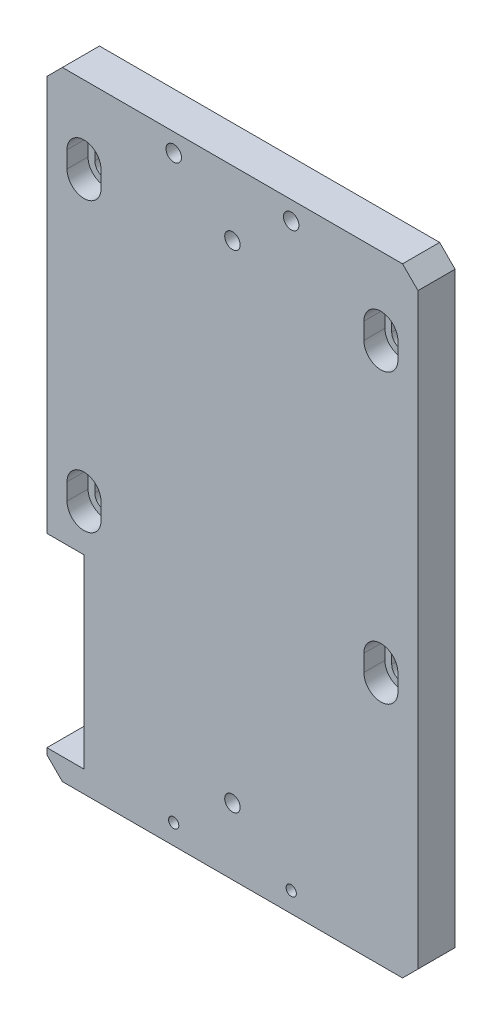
ISO-10303-21;
HEADER;
FILE_DESCRIPTION(('STEP AP214'),'2;1');
FILE_NAME('part.step','',(''),(''),'','','');
FILE_SCHEMA(('AUTOMOTIVE_DESIGN { 1 0 10303 214 1 1 1 1 }'));
ENDSEC;
DATA;
#1=APPLICATION_CONTEXT('core data for automotive mechanical design processes');
#2=APPLICATION_PROTOCOL_DEFINITION('international standard','automotive_design',2000,#1);
#3=PRODUCT_CONTEXT('',#1,'mechanical');
#4=PRODUCT('Part','Part','',(#3));
#5=PRODUCT_RELATED_PRODUCT_CATEGORY('part','',(#4));
#6=PRODUCT_DEFINITION_FORMATION('','',#4);
#7=PRODUCT_DEFINITION_CONTEXT('part definition',#1,'design');
#8=PRODUCT_DEFINITION('design','',#6,#7);
#9=PRODUCT_DEFINITION_SHAPE('','',#8);
#10=(LENGTH_UNIT() NAMED_UNIT(*) SI_UNIT(.MILLI.,.METRE.));
#11=(NAMED_UNIT(*) PLANE_ANGLE_UNIT() SI_UNIT($,.RADIAN.));
#12=(NAMED_UNIT(*) SI_UNIT($,.STERADIAN.) SOLID_ANGLE_UNIT());
#13=UNCERTAINTY_MEASURE_WITH_UNIT(LENGTH_MEASURE(1.E-05),#10,'distance_accuracy_value','');
#14=(GEOMETRIC_REPRESENTATION_CONTEXT(3) GLOBAL_UNCERTAINTY_ASSIGNED_CONTEXT((#13)) GLOBAL_UNIT_ASSIGNED_CONTEXT((#10,
#11,#12)) REPRESENTATION_CONTEXT('',''));
#15=CARTESIAN_POINT('',(0.,0.,0.));
#16=DIRECTION('',(0.,0.,1.));
#17=DIRECTION('',(1.,0.,0.));
#18=AXIS2_PLACEMENT_3D('',#15,#16,#17);
#19=CARTESIAN_POINT('',(0.,0.,12.));
#20=DIRECTION('',(0.,0.,1.));
#21=DIRECTION('',(1.,0.,0.));
#22=AXIS2_PLACEMENT_3D('',#19,#20,#21);
#23=PLANE('',#22);
#24=CARTESIAN_POINT('',(-48.,72.3,12.));
#25=DIRECTION('',(0.,0.,1.));
#26=DIRECTION('',(1.,0.,0.));
#27=AXIS2_PLACEMENT_3D('',#24,#25,#26);
#28=CIRCLE('',#27,5.5);
#29=CARTESIAN_POINT('',(-53.5,72.3,12.));
#30=VERTEX_POINT('',#29);
#31=CARTESIAN_POINT('',(-42.5,72.3,12.));
#32=VERTEX_POINT('',#31);
#33=EDGE_CURVE('E350',#30,#32,#28,.T.);
#34=ORIENTED_EDGE('',*,*,#33,.F.);
#35=DIRECTION('',(0.,-1.,0.));
#36=VECTOR('',#35,1.);
#37=CARTESIAN_POINT('',(-53.5,77.7,12.));
#38=LINE('',#37,#36);
#39=CARTESIAN_POINT('',(-53.5,77.7,12.));
#40=VERTEX_POINT('',#39);
#41=EDGE_CURVE('E1363',#40,#30,#38,.T.);
#42=ORIENTED_EDGE('',*,*,#41,.F.);
#43=CARTESIAN_POINT('',(-48.,77.7,12.));
#44=DIRECTION('',(0.,0.,1.));
#45=DIRECTION('',(1.,0.,0.));
#46=AXIS2_PLACEMENT_3D('',#43,#44,#45);
#47=CIRCLE('',#46,5.5);
#48=CARTESIAN_POINT('',(-42.5,77.7,12.));
#49=VERTEX_POINT('',#48);
#50=EDGE_CURVE('E323',#49,#40,#47,.T.);
#51=ORIENTED_EDGE('',*,*,#50,.F.);
#52=DIRECTION('',(0.,-1.,0.));
#53=VECTOR('',#52,1.);
#54=CARTESIAN_POINT('',(-42.5,77.7,12.));
#55=LINE('',#54,#53);
#56=EDGE_CURVE('E316',#49,#32,#55,.T.);
#57=ORIENTED_EDGE('',*,*,#56,.T.);
#58=EDGE_LOOP('',(#34,#42,#51,#57));
#59=FACE_BOUND('',#58,.T.);
#60=CARTESIAN_POINT('',(0.,-78.5,12.));
#61=DIRECTION('',(0.,0.,1.));
#62=DIRECTION('',(1.,0.,0.));
#63=AXIS2_PLACEMENT_3D('',#60,#61,#62);
#64=CIRCLE('',#63,2.5);
#65=CARTESIAN_POINT('',(2.5,-78.5,12.));
#66=VERTEX_POINT('',#65);
#67=EDGE_CURVE('E552',#66,#66,#64,.T.);
#68=ORIENTED_EDGE('',*,*,#67,.F.);
#69=EDGE_LOOP('',(#68));
#70=FACE_BOUND('',#69,.T.);
#71=CARTESIAN_POINT('',(0.,79.,12.));
#72=DIRECTION('',(0.,0.,1.));
#73=DIRECTION('',(1.,0.,0.));
#74=AXIS2_PLACEMENT_3D('',#71,#72,#73);
#75=CIRCLE('',#74,2.5);
#76=CARTESIAN_POINT('',(2.5,79.,12.));
#77=VERTEX_POINT('',#76);
#78=EDGE_CURVE('E558',#77,#77,#75,.T.);
#79=ORIENTED_EDGE('',*,*,#78,.F.);
#80=EDGE_LOOP('',(#79));
#81=FACE_BOUND('',#80,.T.);
#82=CARTESIAN_POINT('',(-19.,94.,12.));
#83=DIRECTION('',(0.,0.,1.));
#84=DIRECTION('',(1.,0.,0.));
#85=AXIS2_PLACEMENT_3D('',#82,#83,#84);
#86=CIRCLE('',#85,2.5);
#87=CARTESIAN_POINT('',(-16.5,94.,12.));
#88=VERTEX_POINT('',#87);
#89=EDGE_CURVE('E564',#88,#88,#86,.T.);
#90=ORIENTED_EDGE('',*,*,#89,.F.);
#91=EDGE_LOOP('',(#90));
#92=FACE_BOUND('',#91,.T.);
#93=CARTESIAN_POINT('',(19.,94.,12.));
#94=DIRECTION('',(0.,0.,1.));
#95=DIRECTION('',(1.,0.,0.));
#96=AXIS2_PLACEMENT_3D('',#93,#94,#95);
#97=CIRCLE('',#96,2.5);
#98=CARTESIAN_POINT('',(21.5,94.,12.));
#99=VERTEX_POINT('',#98);
#100=EDGE_CURVE('E570',#99,#99,#97,.T.);
#101=ORIENTED_EDGE('',*,*,#100,.F.);
#102=EDGE_LOOP('',(#101));
#103=FACE_BOUND('',#102,.T.);
#104=CARTESIAN_POINT('',(-19.,-93.5,12.));
#105=DIRECTION('',(0.,0.,1.));
#106=DIRECTION('',(1.,0.,0.));
#107=AXIS2_PLACEMENT_3D('',#104,#105,#106);
#108=CIRCLE('',#107,1.65);
#109=CARTESIAN_POINT('',(-17.35,-93.5,12.));
#110=VERTEX_POINT('',#109);
#111=EDGE_CURVE('E576',#110,#110,#108,.T.);
#112=ORIENTED_EDGE('',*,*,#111,.F.);
#113=EDGE_LOOP('',(#112));
#114=FACE_BOUND('',#113,.T.);
#115=CARTESIAN_POINT('',(19.,-93.5,12.));
#116=DIRECTION('',(0.,0.,1.));
#117=DIRECTION('',(1.,0.,0.));
#118=AXIS2_PLACEMENT_3D('',#115,#116,#117);
#119=CIRCLE('',#118,1.65);
#120=CARTESIAN_POINT('',(20.65,-93.5,12.));
#121=VERTEX_POINT('',#120);
#122=EDGE_CURVE('E582',#121,#121,#119,.T.);
#123=ORIENTED_EDGE('',*,*,#122,.F.);
#124=EDGE_LOOP('',(#123));
#125=FACE_BOUND('',#124,.T.);
#126=DIRECTION('',(-1.,0.,0.));
#127=VECTOR('',#126,1.);
#128=CARTESIAN_POINT('',(-60.,100.,12.));
#129=LINE('',#128,#127);
#130=CARTESIAN_POINT('',(55.,100.,12.));
#131=VERTEX_POINT('',#130);
#132=CARTESIAN_POINT('',(-55.,100.,12.));
#133=VERTEX_POINT('',#132);
#134=EDGE_CURVE('E637',#131,#133,#129,.T.);
#135=ORIENTED_EDGE('',*,*,#134,.T.);
#136=DIRECTION('',(0.70710678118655,0.707106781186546,0.));
#137=VECTOR('',#136,1.);
#138=CARTESIAN_POINT('',(-77.5,77.5,12.));
#139=LINE('',#138,#137);
#140=CARTESIAN_POINT('',(-60.,95.,12.));
#141=VERTEX_POINT('',#140);
#142=EDGE_CURVE('E679',#133,#141,#139,.F.);
#143=ORIENTED_EDGE('',*,*,#142,.T.);
#144=DIRECTION('',(0.,-1.,0.));
#145=VECTOR('',#144,1.);
#146=CARTESIAN_POINT('',(-60.,100.,12.));
#147=LINE('',#146,#145);
#148=CARTESIAN_POINT('',(-60.,-33.,12.));
#149=VERTEX_POINT('',#148);
#150=EDGE_CURVE('E642',#141,#149,#147,.T.);
#151=ORIENTED_EDGE('',*,*,#150,.T.);
#152=DIRECTION('',(-1.,0.,0.));
#153=VECTOR('',#152,1.);
#154=CARTESIAN_POINT('',(-60.,-33.,12.));
#155=LINE('',#154,#153);
#156=CARTESIAN_POINT('',(-48.,-33.,12.));
#157=VERTEX_POINT('',#156);
#158=EDGE_CURVE('E611',#157,#149,#155,.T.);
#159=ORIENTED_EDGE('',*,*,#158,.F.);
#160=DIRECTION('',(0.,1.,0.));
#161=VECTOR('',#160,1.);
#162=CARTESIAN_POINT('',(-48.,-33.,12.));
#163=LINE('',#162,#161);
#164=CARTESIAN_POINT('',(-48.,-93.,12.));
#165=VERTEX_POINT('',#164);
#166=EDGE_CURVE('E620',#165,#157,#163,.T.);
#167=ORIENTED_EDGE('',*,*,#166,.F.);
#168=DIRECTION('',(1.,0.,0.));
#169=VECTOR('',#168,1.);
#170=CARTESIAN_POINT('',(-60.,-93.,12.));
#171=LINE('',#170,#169);
#172=CARTESIAN_POINT('',(-60.,-93.,12.));
#173=VERTEX_POINT('',#172);
#174=EDGE_CURVE('E606',#173,#165,#171,.T.);
#175=ORIENTED_EDGE('',*,*,#174,.F.);
#176=CARTESIAN_POINT('',(-60.,-95.,12.));
#177=VERTEX_POINT('',#176);
#178=EDGE_CURVE('E641',#173,#177,#147,.T.);
#179=ORIENTED_EDGE('',*,*,#178,.T.);
#180=DIRECTION('',(-0.707106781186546,0.70710678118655,0.));
#181=VECTOR('',#180,1.);
#182=CARTESIAN_POINT('',(-77.5,-77.5,12.));
#183=LINE('',#182,#181);
#184=CARTESIAN_POINT('',(-55.,-100.,12.));
#185=VERTEX_POINT('',#184);
#186=EDGE_CURVE('E675',#177,#185,#183,.F.);
#187=ORIENTED_EDGE('',*,*,#186,.T.);
#188=DIRECTION('',(1.,0.,0.));
#189=VECTOR('',#188,1.);
#190=CARTESIAN_POINT('',(-60.,-100.,12.));
#191=LINE('',#190,#189);
#192=CARTESIAN_POINT('',(55.,-100.,12.));
#193=VERTEX_POINT('',#192);
#194=EDGE_CURVE('E644',#185,#193,#191,.T.);
#195=ORIENTED_EDGE('',*,*,#194,.T.);
#196=DIRECTION('',(-0.70710678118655,-0.707106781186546,0.));
#197=VECTOR('',#196,1.);
#198=CARTESIAN_POINT('',(77.5,-77.5,12.));
#199=LINE('',#198,#197);
#200=CARTESIAN_POINT('',(60.,-95.,12.));
#201=VERTEX_POINT('',#200);
#202=EDGE_CURVE('E673',#193,#201,#199,.F.);
#203=ORIENTED_EDGE('',*,*,#202,.T.);
#204=DIRECTION('',(0.,1.,0.));
#205=VECTOR('',#204,1.);
#206=CARTESIAN_POINT('',(60.,100.,12.));
#207=LINE('',#206,#205);
#208=CARTESIAN_POINT('',(60.,95.,12.));
#209=VERTEX_POINT('',#208);
#210=EDGE_CURVE('E634',#201,#209,#207,.T.);
#211=ORIENTED_EDGE('',*,*,#210,.T.);
#212=DIRECTION('',(0.707106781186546,-0.70710678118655,0.));
#213=VECTOR('',#212,1.);
#214=CARTESIAN_POINT('',(77.5,77.5,12.));
#215=LINE('',#214,#213);
#216=EDGE_CURVE('E677',#209,#131,#215,.F.);
#217=ORIENTED_EDGE('',*,*,#216,.T.);
#218=EDGE_LOOP('',(#135,#143,#151,#159,#167,#175,#179,#187,#195,#203,#211,#217));
#219=FACE_BOUND('',#218,.T.);
#220=CARTESIAN_POINT('',(48.,-15.3,12.));
#221=DIRECTION('',(0.,0.,1.));
#222=DIRECTION('',(1.,0.,0.));
#223=AXIS2_PLACEMENT_3D('',#220,#221,#222);
#224=CIRCLE('',#223,5.5);
#225=CARTESIAN_POINT('',(53.5,-15.3,12.));
#226=VERTEX_POINT('',#225);
#227=CARTESIAN_POINT('',(42.5,-15.3,12.));
#228=VERTEX_POINT('',#227);
#229=EDGE_CURVE('E517',#226,#228,#224,.T.);
#230=ORIENTED_EDGE('',*,*,#229,.F.);
#231=DIRECTION('',(0.,-1.,0.));
#232=VECTOR('',#231,1.);
#233=CARTESIAN_POINT('',(53.5,-15.3,12.));
#234=LINE('',#233,#232);
#235=CARTESIAN_POINT('',(53.5,-20.7,12.));
#236=VERTEX_POINT('',#235);
#237=EDGE_CURVE('E505',#226,#236,#234,.T.);
#238=ORIENTED_EDGE('',*,*,#237,.T.);
#239=CARTESIAN_POINT('',(48.,-20.7,12.));
#240=DIRECTION('',(0.,0.,1.));
#241=DIRECTION('',(1.,0.,0.));
#242=AXIS2_PLACEMENT_3D('',#239,#240,#241);
#243=CIRCLE('',#242,5.5);
#244=CARTESIAN_POINT('',(42.5,-20.7,12.));
#245=VERTEX_POINT('',#244);
#246=EDGE_CURVE('E538',#245,#236,#243,.T.);
#247=ORIENTED_EDGE('',*,*,#246,.F.);
#248=DIRECTION('',(0.,-1.,0.));
#249=VECTOR('',#248,1.);
#250=CARTESIAN_POINT('',(42.5,-15.3,12.));
#251=LINE('',#250,#249);
#252=EDGE_CURVE('E488',#228,#245,#251,.T.);
#253=ORIENTED_EDGE('',*,*,#252,.F.);
#254=EDGE_LOOP('',(#230,#238,#247,#253));
#255=FACE_BOUND('',#254,.T.);
#256=CARTESIAN_POINT('',(48.,77.7,12.));
#257=DIRECTION('',(0.,0.,1.));
#258=DIRECTION('',(1.,0.,0.));
#259=AXIS2_PLACEMENT_3D('',#256,#257,#258);
#260=CIRCLE('',#259,5.5);
#261=CARTESIAN_POINT('',(53.5,77.7,12.));
#262=VERTEX_POINT('',#261);
#263=CARTESIAN_POINT('',(42.5,77.7,12.));
#264=VERTEX_POINT('',#263);
#265=EDGE_CURVE('E453',#262,#264,#260,.T.);
#266=ORIENTED_EDGE('',*,*,#265,.F.);
#267=DIRECTION('',(0.,-1.,0.));
#268=VECTOR('',#267,1.);
#269=CARTESIAN_POINT('',(53.5,77.7,12.));
#270=LINE('',#269,#268);
#271=CARTESIAN_POINT('',(53.5,72.3,12.));
#272=VERTEX_POINT('',#271);
#273=EDGE_CURVE('E441',#262,#272,#270,.T.);
#274=ORIENTED_EDGE('',*,*,#273,.T.);
#275=CARTESIAN_POINT('',(48.,72.3,12.));
#276=DIRECTION('',(0.,0.,1.));
#277=DIRECTION('',(1.,0.,0.));
#278=AXIS2_PLACEMENT_3D('',#275,#276,#277);
#279=CIRCLE('',#278,5.5);
#280=CARTESIAN_POINT('',(42.5,72.3,12.));
#281=VERTEX_POINT('',#280);
#282=EDGE_CURVE('E474',#281,#272,#279,.T.);
#283=ORIENTED_EDGE('',*,*,#282,.F.);
#284=DIRECTION('',(0.,-1.,0.));
#285=VECTOR('',#284,1.);
#286=CARTESIAN_POINT('',(42.5,77.7,12.));
#287=LINE('',#286,#285);
#288=EDGE_CURVE('E424',#264,#281,#287,.T.);
#289=ORIENTED_EDGE('',*,*,#288,.F.);
#290=EDGE_LOOP('',(#266,#274,#283,#289));
#291=FACE_BOUND('',#290,.T.);
#292=CARTESIAN_POINT('',(-48.,-15.3,12.));
#293=DIRECTION('',(0.,0.,1.));
#294=DIRECTION('',(1.,0.,0.));
#295=AXIS2_PLACEMENT_3D('',#292,#293,#294);
#296=CIRCLE('',#295,5.5);
#297=CARTESIAN_POINT('',(-42.5,-15.3,12.));
#298=VERTEX_POINT('',#297);
#299=CARTESIAN_POINT('',(-53.5,-15.3,12.));
#300=VERTEX_POINT('',#299);
#301=EDGE_CURVE('E389',#298,#300,#296,.T.);
#302=ORIENTED_EDGE('',*,*,#301,.F.);
#303=DIRECTION('',(0.,-1.,0.));
#304=VECTOR('',#303,1.);
#305=CARTESIAN_POINT('',(-42.5,-15.3,12.));
#306=LINE('',#305,#304);
#307=CARTESIAN_POINT('',(-42.5,-20.7,12.));
#308=VERTEX_POINT('',#307);
#309=EDGE_CURVE('E377',#298,#308,#306,.T.);
#310=ORIENTED_EDGE('',*,*,#309,.T.);
#311=CARTESIAN_POINT('',(-48.,-20.7,12.));
#312=DIRECTION('',(0.,0.,1.));
#313=DIRECTION('',(1.,0.,0.));
#314=AXIS2_PLACEMENT_3D('',#311,#312,#313);
#315=CIRCLE('',#314,5.5);
#316=CARTESIAN_POINT('',(-53.5,-20.7,12.));
#317=VERTEX_POINT('',#316);
#318=EDGE_CURVE('E410',#317,#308,#315,.T.);
#319=ORIENTED_EDGE('',*,*,#318,.F.);
#320=DIRECTION('',(0.,-1.,0.));
#321=VECTOR('',#320,1.);
#322=CARTESIAN_POINT('',(-53.5,-15.3,12.));
#323=LINE('',#322,#321);
#324=EDGE_CURVE('E360',#300,#317,#323,.T.);
#325=ORIENTED_EDGE('',*,*,#324,.F.);
#326=EDGE_LOOP('',(#302,#310,#319,#325));
#327=FACE_BOUND('',#326,.T.);
#328=ADVANCED_FACE('F16',(#59,#70,#81,#92,#103,#114,#125,#219,#255,#291,#327),#23,.T.);
#329=CARTESIAN_POINT('',(0.,0.,0.));
#330=DIRECTION('',(0.,0.,1.));
#331=DIRECTION('',(1.,0.,0.));
#332=AXIS2_PLACEMENT_3D('',#329,#330,#331);
#333=PLANE('',#332);
#334=DIRECTION('',(0.,-1.,0.));
#335=VECTOR('',#334,1.);
#336=CARTESIAN_POINT('',(-51.3,77.7,0.));
#337=LINE('',#336,#335);
#338=CARTESIAN_POINT('',(-51.3,77.7,0.));
#339=VERTEX_POINT('',#338);
#340=CARTESIAN_POINT('',(-51.3,72.3,0.));
#341=VERTEX_POINT('',#340);
#342=EDGE_CURVE('E1369',#339,#341,#337,.T.);
#343=ORIENTED_EDGE('',*,*,#342,.T.);
#344=CARTESIAN_POINT('',(-48.,72.3,0.));
#345=DIRECTION('',(0.,0.,1.));
#346=DIRECTION('',(1.,0.,0.));
#347=AXIS2_PLACEMENT_3D('',#344,#345,#346);
#348=CIRCLE('',#347,3.3);
#349=CARTESIAN_POINT('',(-44.7,72.3,0.));
#350=VERTEX_POINT('',#349);
#351=EDGE_CURVE('E39',#341,#350,#348,.T.);
#352=ORIENTED_EDGE('',*,*,#351,.T.);
#353=DIRECTION('',(0.,-1.,0.));
#354=VECTOR('',#353,1.);
#355=CARTESIAN_POINT('',(-44.7,77.7,0.));
#356=LINE('',#355,#354);
#357=CARTESIAN_POINT('',(-44.7,77.7,0.));
#358=VERTEX_POINT('',#357);
#359=EDGE_CURVE('E1366',#358,#350,#356,.T.);
#360=ORIENTED_EDGE('',*,*,#359,.F.);
#361=CARTESIAN_POINT('',(-48.,77.7,0.));
#362=DIRECTION('',(0.,0.,1.));
#363=DIRECTION('',(1.,0.,0.));
#364=AXIS2_PLACEMENT_3D('',#361,#362,#363);
#365=CIRCLE('',#364,3.3);
#366=EDGE_CURVE('E340',#358,#339,#365,.T.);
#367=ORIENTED_EDGE('',*,*,#366,.T.);
#368=EDGE_LOOP('',(#343,#352,#360,#367));
#369=FACE_BOUND('',#368,.T.);
#370=DIRECTION('',(0.,-1.,0.));
#371=VECTOR('',#370,1.);
#372=CARTESIAN_POINT('',(-51.3,-15.3,0.));
#373=LINE('',#372,#371);
#374=CARTESIAN_POINT('',(-51.3,-15.3,0.));
#375=VERTEX_POINT('',#374);
#376=CARTESIAN_POINT('',(-51.3,-20.7,0.));
#377=VERTEX_POINT('',#376);
#378=EDGE_CURVE('E366',#375,#377,#373,.T.);
#379=ORIENTED_EDGE('',*,*,#378,.T.);
#380=CARTESIAN_POINT('',(-48.,-20.7,0.));
#381=DIRECTION('',(0.,0.,1.));
#382=DIRECTION('',(1.,0.,0.));
#383=AXIS2_PLACEMENT_3D('',#380,#381,#382);
#384=CIRCLE('',#383,3.3);
#385=CARTESIAN_POINT('',(-44.7,-20.7,0.));
#386=VERTEX_POINT('',#385);
#387=EDGE_CURVE('E418',#377,#386,#384,.T.);
#388=ORIENTED_EDGE('',*,*,#387,.T.);
#389=DIRECTION('',(0.,-1.,0.));
#390=VECTOR('',#389,1.);
#391=CARTESIAN_POINT('',(-44.7,-15.3,0.));
#392=LINE('',#391,#390);
#393=CARTESIAN_POINT('',(-44.7,-15.3,0.));
#394=VERTEX_POINT('',#393);
#395=EDGE_CURVE('E369',#394,#386,#392,.T.);
#396=ORIENTED_EDGE('',*,*,#395,.F.);
#397=CARTESIAN_POINT('',(-48.,-15.3,0.));
#398=DIRECTION('',(0.,0.,1.));
#399=DIRECTION('',(1.,0.,0.));
#400=AXIS2_PLACEMENT_3D('',#397,#398,#399);
#401=CIRCLE('',#400,3.3);
#402=EDGE_CURVE('E397',#394,#375,#401,.T.);
#403=ORIENTED_EDGE('',*,*,#402,.T.);
#404=EDGE_LOOP('',(#379,#388,#396,#403));
#405=FACE_BOUND('',#404,.T.);
#406=DIRECTION('',(0.,-1.,0.));
#407=VECTOR('',#406,1.);
#408=CARTESIAN_POINT('',(51.3,-15.3,0.));
#409=LINE('',#408,#407);
#410=CARTESIAN_POINT('',(51.3,-15.3,0.));
#411=VERTEX_POINT('',#410);
#412=CARTESIAN_POINT('',(51.3,-20.7,0.));
#413=VERTEX_POINT('',#412);
#414=EDGE_CURVE('E497',#411,#413,#409,.T.);
#415=ORIENTED_EDGE('',*,*,#414,.F.);
#416=CARTESIAN_POINT('',(48.,-15.3,0.));
#417=DIRECTION('',(0.,0.,1.));
#418=DIRECTION('',(1.,0.,0.));
#419=AXIS2_PLACEMENT_3D('',#416,#417,#418);
#420=CIRCLE('',#419,3.3);
#421=CARTESIAN_POINT('',(44.7,-15.3,0.));
#422=VERTEX_POINT('',#421);
#423=EDGE_CURVE('E525',#411,#422,#420,.T.);
#424=ORIENTED_EDGE('',*,*,#423,.T.);
#425=DIRECTION('',(0.,-1.,0.));
#426=VECTOR('',#425,1.);
#427=CARTESIAN_POINT('',(44.7,-15.3,0.));
#428=LINE('',#427,#426);
#429=CARTESIAN_POINT('',(44.7,-20.7,0.));
#430=VERTEX_POINT('',#429);
#431=EDGE_CURVE('E494',#422,#430,#428,.T.);
#432=ORIENTED_EDGE('',*,*,#431,.T.);
#433=CARTESIAN_POINT('',(48.,-20.7,0.));
#434=DIRECTION('',(0.,0.,1.));
#435=DIRECTION('',(1.,0.,0.));
#436=AXIS2_PLACEMENT_3D('',#433,#434,#435);
#437=CIRCLE('',#436,3.3);
#438=EDGE_CURVE('E546',#430,#413,#437,.T.);
#439=ORIENTED_EDGE('',*,*,#438,.T.);
#440=EDGE_LOOP('',(#415,#424,#432,#439));
#441=FACE_BOUND('',#440,.T.);
#442=CARTESIAN_POINT('',(0.,-78.5,0.));
#443=DIRECTION('',(0.,0.,1.));
#444=DIRECTION('',(1.,0.,0.));
#445=AXIS2_PLACEMENT_3D('',#442,#443,#444);
#446=CIRCLE('',#445,2.5);
#447=CARTESIAN_POINT('',(2.5,-78.5,0.));
#448=VERTEX_POINT('',#447);
#449=EDGE_CURVE('E555',#448,#448,#446,.T.);
#450=ORIENTED_EDGE('',*,*,#449,.T.);
#451=EDGE_LOOP('',(#450));
#452=FACE_BOUND('',#451,.T.);
#453=CARTESIAN_POINT('',(0.,79.,0.));
#454=DIRECTION('',(0.,0.,1.));
#455=DIRECTION('',(1.,0.,0.));
#456=AXIS2_PLACEMENT_3D('',#453,#454,#455);
#457=CIRCLE('',#456,2.5);
#458=CARTESIAN_POINT('',(2.5,79.,0.));
#459=VERTEX_POINT('',#458);
#460=EDGE_CURVE('E561',#459,#459,#457,.T.);
#461=ORIENTED_EDGE('',*,*,#460,.T.);
#462=EDGE_LOOP('',(#461));
#463=FACE_BOUND('',#462,.T.);
#464=CARTESIAN_POINT('',(-19.,94.,0.));
#465=DIRECTION('',(0.,0.,1.));
#466=DIRECTION('',(1.,0.,0.));
#467=AXIS2_PLACEMENT_3D('',#464,#465,#466);
#468=CIRCLE('',#467,2.5);
#469=CARTESIAN_POINT('',(-16.5,94.,0.));
#470=VERTEX_POINT('',#469);
#471=EDGE_CURVE('E567',#470,#470,#468,.T.);
#472=ORIENTED_EDGE('',*,*,#471,.T.);
#473=EDGE_LOOP('',(#472));
#474=FACE_BOUND('',#473,.T.);
#475=CARTESIAN_POINT('',(19.,94.,0.));
#476=DIRECTION('',(0.,0.,1.));
#477=DIRECTION('',(1.,0.,0.));
#478=AXIS2_PLACEMENT_3D('',#475,#476,#477);
#479=CIRCLE('',#478,2.5);
#480=CARTESIAN_POINT('',(21.5,94.,0.));
#481=VERTEX_POINT('',#480);
#482=EDGE_CURVE('E573',#481,#481,#479,.T.);
#483=ORIENTED_EDGE('',*,*,#482,.T.);
#484=EDGE_LOOP('',(#483));
#485=FACE_BOUND('',#484,.T.);
#486=CARTESIAN_POINT('',(-19.,-93.5,0.));
#487=DIRECTION('',(0.,0.,1.));
#488=DIRECTION('',(1.,0.,0.));
#489=AXIS2_PLACEMENT_3D('',#486,#487,#488);
#490=CIRCLE('',#489,1.65);
#491=CARTESIAN_POINT('',(-17.35,-93.5,0.));
#492=VERTEX_POINT('',#491);
#493=EDGE_CURVE('E579',#492,#492,#490,.T.);
#494=ORIENTED_EDGE('',*,*,#493,.T.);
#495=EDGE_LOOP('',(#494));
#496=FACE_BOUND('',#495,.T.);
#497=CARTESIAN_POINT('',(19.,-93.5,0.));
#498=DIRECTION('',(0.,0.,1.));
#499=DIRECTION('',(1.,0.,0.));
#500=AXIS2_PLACEMENT_3D('',#497,#498,#499);
#501=CIRCLE('',#500,1.65);
#502=CARTESIAN_POINT('',(20.65,-93.5,0.));
#503=VERTEX_POINT('',#502);
#504=EDGE_CURVE('E585',#503,#503,#501,.T.);
#505=ORIENTED_EDGE('',*,*,#504,.T.);
#506=EDGE_LOOP('',(#505));
#507=FACE_BOUND('',#506,.T.);
#508=DIRECTION('',(0.,-1.,0.));
#509=VECTOR('',#508,1.);
#510=CARTESIAN_POINT('',(-60.,100.,0.));
#511=LINE('',#510,#509);
#512=CARTESIAN_POINT('',(-60.,95.,0.));
#513=VERTEX_POINT('',#512);
#514=CARTESIAN_POINT('',(-60.,-33.,0.));
#515=VERTEX_POINT('',#514);
#516=EDGE_CURVE('E654',#513,#515,#511,.T.);
#517=ORIENTED_EDGE('',*,*,#516,.F.);
#518=DIRECTION('',(-0.70710678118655,-0.707106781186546,0.));
#519=VECTOR('',#518,1.);
#520=CARTESIAN_POINT('',(-60.,95.,0.));
#521=LINE('',#520,#519);
#522=CARTESIAN_POINT('',(-55.,100.,0.));
#523=VERTEX_POINT('',#522);
#524=EDGE_CURVE('E666',#513,#523,#521,.F.);
#525=ORIENTED_EDGE('',*,*,#524,.T.);
#526=DIRECTION('',(-1.,0.,0.));
#527=VECTOR('',#526,1.);
#528=CARTESIAN_POINT('',(-60.,100.,0.));
#529=LINE('',#528,#527);
#530=CARTESIAN_POINT('',(55.,100.,0.));
#531=VERTEX_POINT('',#530);
#532=EDGE_CURVE('E650',#531,#523,#529,.T.);
#533=ORIENTED_EDGE('',*,*,#532,.F.);
#534=DIRECTION('',(-0.707106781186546,0.70710678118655,0.));
#535=VECTOR('',#534,1.);
#536=CARTESIAN_POINT('',(55.,100.,0.));
#537=LINE('',#536,#535);
#538=CARTESIAN_POINT('',(60.,95.,0.));
#539=VERTEX_POINT('',#538);
#540=EDGE_CURVE('E664',#531,#539,#537,.F.);
#541=ORIENTED_EDGE('',*,*,#540,.T.);
#542=DIRECTION('',(0.,1.,0.));
#543=VECTOR('',#542,1.);
#544=CARTESIAN_POINT('',(60.,100.,0.));
#545=LINE('',#544,#543);
#546=CARTESIAN_POINT('',(60.,-95.,0.));
#547=VERTEX_POINT('',#546);
#548=EDGE_CURVE('E628',#547,#539,#545,.T.);
#549=ORIENTED_EDGE('',*,*,#548,.F.);
#550=DIRECTION('',(0.70710678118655,0.707106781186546,0.));
#551=VECTOR('',#550,1.);
#552=CARTESIAN_POINT('',(60.,-95.,0.));
#553=LINE('',#552,#551);
#554=CARTESIAN_POINT('',(55.,-100.,0.));
#555=VERTEX_POINT('',#554);
#556=EDGE_CURVE('E660',#547,#555,#553,.F.);
#557=ORIENTED_EDGE('',*,*,#556,.T.);
#558=DIRECTION('',(1.,0.,0.));
#559=VECTOR('',#558,1.);
#560=CARTESIAN_POINT('',(-60.,-100.,0.));
#561=LINE('',#560,#559);
#562=CARTESIAN_POINT('',(-55.,-100.,0.));
#563=VERTEX_POINT('',#562);
#564=EDGE_CURVE('E638',#563,#555,#561,.T.);
#565=ORIENTED_EDGE('',*,*,#564,.F.);
#566=DIRECTION('',(0.707106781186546,-0.70710678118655,0.));
#567=VECTOR('',#566,1.);
#568=CARTESIAN_POINT('',(-55.,-100.,0.));
#569=LINE('',#568,#567);
#570=CARTESIAN_POINT('',(-60.,-95.,0.));
#571=VERTEX_POINT('',#570);
#572=EDGE_CURVE('E662',#563,#571,#569,.F.);
#573=ORIENTED_EDGE('',*,*,#572,.T.);
#574=CARTESIAN_POINT('',(-60.,-93.,0.));
#575=VERTEX_POINT('',#574);
#576=EDGE_CURVE('E653',#575,#571,#511,.T.);
#577=ORIENTED_EDGE('',*,*,#576,.F.);
#578=DIRECTION('',(1.,0.,0.));
#579=VECTOR('',#578,1.);
#580=CARTESIAN_POINT('',(-60.,-93.,0.));
#581=LINE('',#580,#579);
#582=CARTESIAN_POINT('',(-48.,-93.,0.));
#583=VERTEX_POINT('',#582);
#584=EDGE_CURVE('E607',#575,#583,#581,.T.);
#585=ORIENTED_EDGE('',*,*,#584,.T.);
#586=DIRECTION('',(0.,1.,0.));
#587=VECTOR('',#586,1.);
#588=CARTESIAN_POINT('',(-48.,-33.,0.));
#589=LINE('',#588,#587);
#590=CARTESIAN_POINT('',(-48.,-33.,0.));
#591=VERTEX_POINT('',#590);
#592=EDGE_CURVE('E610',#583,#591,#589,.T.);
#593=ORIENTED_EDGE('',*,*,#592,.T.);
#594=DIRECTION('',(-1.,0.,0.));
#595=VECTOR('',#594,1.);
#596=CARTESIAN_POINT('',(-60.,-33.,0.));
#597=LINE('',#596,#595);
#598=EDGE_CURVE('E614',#591,#515,#597,.T.);
#599=ORIENTED_EDGE('',*,*,#598,.T.);
#600=EDGE_LOOP('',(#517,#525,#533,#541,#549,#557,#565,#573,#577,#585,#593,#599));
#601=FACE_BOUND('',#600,.T.);
#602=DIRECTION('',(0.,-1.,0.));
#603=VECTOR('',#602,1.);
#604=CARTESIAN_POINT('',(51.3,77.7,0.));
#605=LINE('',#604,#603);
#606=CARTESIAN_POINT('',(51.3,77.7,0.));
#607=VERTEX_POINT('',#606);
#608=CARTESIAN_POINT('',(51.3,72.3,0.));
#609=VERTEX_POINT('',#608);
#610=EDGE_CURVE('E433',#607,#609,#605,.T.);
#611=ORIENTED_EDGE('',*,*,#610,.F.);
#612=CARTESIAN_POINT('',(48.,77.7,0.));
#613=DIRECTION('',(0.,0.,1.));
#614=DIRECTION('',(1.,0.,0.));
#615=AXIS2_PLACEMENT_3D('',#612,#613,#614);
#616=CIRCLE('',#615,3.3);
#617=CARTESIAN_POINT('',(44.7,77.7,0.));
#618=VERTEX_POINT('',#617);
#619=EDGE_CURVE('E461',#607,#618,#616,.T.);
#620=ORIENTED_EDGE('',*,*,#619,.T.);
#621=DIRECTION('',(0.,-1.,0.));
#622=VECTOR('',#621,1.);
#623=CARTESIAN_POINT('',(44.7,77.7,0.));
#624=LINE('',#623,#622);
#625=CARTESIAN_POINT('',(44.7,72.3,0.));
#626=VERTEX_POINT('',#625);
#627=EDGE_CURVE('E430',#618,#626,#624,.T.);
#628=ORIENTED_EDGE('',*,*,#627,.T.);
#629=CARTESIAN_POINT('',(48.,72.3,0.));
#630=DIRECTION('',(0.,0.,1.));
#631=DIRECTION('',(1.,0.,0.));
#632=AXIS2_PLACEMENT_3D('',#629,#630,#631);
#633=CIRCLE('',#632,3.3);
#634=EDGE_CURVE('E482',#626,#609,#633,.T.);
#635=ORIENTED_EDGE('',*,*,#634,.T.);
#636=EDGE_LOOP('',(#611,#620,#628,#635));
#637=FACE_BOUND('',#636,.T.);
#638=ADVANCED_FACE('F698',(#369,#405,#441,#452,#463,#474,#485,#496,#507,#601,#637),#333,.F.);
#639=CARTESIAN_POINT('',(-60.,100.,12.));
#640=DIRECTION('',(1.,0.,0.));
#641=DIRECTION('',(0.,1.,0.));
#642=AXIS2_PLACEMENT_3D('',#639,#640,#641);
#643=PLANE('',#642);
#644=ORIENTED_EDGE('',*,*,#150,.F.);
#645=DIRECTION('',(0.,0.,-1.));
#646=VECTOR('',#645,1.);
#647=CARTESIAN_POINT('',(-60.,95.,12.));
#648=LINE('',#647,#646);
#649=EDGE_CURVE('E647',#141,#513,#648,.T.);
#650=ORIENTED_EDGE('',*,*,#649,.T.);
#651=ORIENTED_EDGE('',*,*,#516,.T.);
#652=DIRECTION('',(0.,0.,1.));
#653=VECTOR('',#652,1.);
#654=CARTESIAN_POINT('',(-60.,-33.,0.));
#655=LINE('',#654,#653);
#656=EDGE_CURVE('E625',#515,#149,#655,.T.);
#657=ORIENTED_EDGE('',*,*,#656,.T.);
#658=EDGE_LOOP('',(#644,#650,#651,#657));
#659=FACE_BOUND('',#658,.T.);
#660=ADVANCED_FACE('F727',(#659),#643,.F.);
#661=CARTESIAN_POINT('',(60.,100.,12.));
#662=DIRECTION('',(-1.,0.,0.));
#663=DIRECTION('',(0.,-1.,0.));
#664=AXIS2_PLACEMENT_3D('',#661,#662,#663);
#665=PLANE('',#664);
#666=ORIENTED_EDGE('',*,*,#548,.T.);
#667=DIRECTION('',(0.,0.,1.));
#668=VECTOR('',#667,1.);
#669=CARTESIAN_POINT('',(60.,95.,12.));
#670=LINE('',#669,#668);
#671=EDGE_CURVE('E684',#539,#209,#670,.T.);
#672=ORIENTED_EDGE('',*,*,#671,.T.);
#673=ORIENTED_EDGE('',*,*,#210,.F.);
#674=DIRECTION('',(0.,0.,-1.));
#675=VECTOR('',#674,1.);
#676=CARTESIAN_POINT('',(60.,-95.,12.));
#677=LINE('',#676,#675);
#678=EDGE_CURVE('E681',#201,#547,#677,.T.);
#679=ORIENTED_EDGE('',*,*,#678,.T.);
#680=EDGE_LOOP('',(#666,#672,#673,#679));
#681=FACE_BOUND('',#680,.T.);
#682=ADVANCED_FACE('F708',(#681),#665,.F.);
#683=CARTESIAN_POINT('',(-60.,100.,12.));
#684=DIRECTION('',(0.,-1.,0.));
#685=DIRECTION('',(0.,0.,-1.));
#686=AXIS2_PLACEMENT_3D('',#683,#684,#685);
#687=PLANE('',#686);
#688=ORIENTED_EDGE('',*,*,#532,.T.);
#689=DIRECTION('',(0.,0.,1.));
#690=VECTOR('',#689,1.);
#691=CARTESIAN_POINT('',(-55.,100.,12.));
#692=LINE('',#691,#690);
#693=EDGE_CURVE('E671',#523,#133,#692,.T.);
#694=ORIENTED_EDGE('',*,*,#693,.T.);
#695=ORIENTED_EDGE('',*,*,#134,.F.);
#696=DIRECTION('',(0.,0.,-1.));
#697=VECTOR('',#696,1.);
#698=CARTESIAN_POINT('',(55.,100.,12.));
#699=LINE('',#698,#697);
#700=EDGE_CURVE('E668',#131,#531,#699,.T.);
#701=ORIENTED_EDGE('',*,*,#700,.T.);
#702=EDGE_LOOP('',(#688,#694,#695,#701));
#703=FACE_BOUND('',#702,.T.);
#704=ADVANCED_FACE('F719',(#703),#687,.F.);
#705=ORIENTED_EDGE('',*,*,#576,.T.);
#706=DIRECTION('',(0.,0.,1.));
#707=VECTOR('',#706,1.);
#708=CARTESIAN_POINT('',(-60.,-95.,12.));
#709=LINE('',#708,#707);
#710=EDGE_CURVE('E11',#571,#177,#709,.T.);
#711=ORIENTED_EDGE('',*,*,#710,.T.);
#712=ORIENTED_EDGE('',*,*,#178,.F.);
#713=DIRECTION('',(0.,0.,1.));
#714=VECTOR('',#713,1.);
#715=CARTESIAN_POINT('',(-60.,-93.,0.));
#716=LINE('',#715,#714);
#717=EDGE_CURVE('E617',#575,#173,#716,.T.);
#718=ORIENTED_EDGE('',*,*,#717,.F.);
#719=EDGE_LOOP('',(#705,#711,#712,#718));
#720=FACE_BOUND('',#719,.T.);
#721=ADVANCED_FACE('F743',(#720),#643,.F.);
#722=CARTESIAN_POINT('',(-60.,-100.,12.));
#723=DIRECTION('',(0.,1.,0.));
#724=DIRECTION('',(0.,0.,1.));
#725=AXIS2_PLACEMENT_3D('',#722,#723,#724);
#726=PLANE('',#725);
#727=ORIENTED_EDGE('',*,*,#194,.F.);
#728=DIRECTION('',(0.,0.,-1.));
#729=VECTOR('',#728,1.);
#730=CARTESIAN_POINT('',(-55.,-100.,12.));
#731=LINE('',#730,#729);
#732=EDGE_CURVE('E24',#185,#563,#731,.T.);
#733=ORIENTED_EDGE('',*,*,#732,.T.);
#734=ORIENTED_EDGE('',*,*,#564,.T.);
#735=DIRECTION('',(0.,0.,1.));
#736=VECTOR('',#735,1.);
#737=CARTESIAN_POINT('',(55.,-100.,12.));
#738=LINE('',#737,#736);
#739=EDGE_CURVE('E686',#555,#193,#738,.T.);
#740=ORIENTED_EDGE('',*,*,#739,.T.);
#741=EDGE_LOOP('',(#727,#733,#734,#740));
#742=FACE_BOUND('',#741,.T.);
#743=ADVANCED_FACE('F692',(#742),#726,.F.);
#744=CARTESIAN_POINT('',(-60.,-33.,0.));
#745=DIRECTION('',(0.,1.,0.));
#746=DIRECTION('',(0.,0.,1.));
#747=AXIS2_PLACEMENT_3D('',#744,#745,#746);
#748=PLANE('',#747);
#749=ORIENTED_EDGE('',*,*,#158,.T.);
#750=ORIENTED_EDGE('',*,*,#656,.F.);
#751=ORIENTED_EDGE('',*,*,#598,.F.);
#752=DIRECTION('',(0.,0.,1.));
#753=VECTOR('',#752,1.);
#754=CARTESIAN_POINT('',(-48.,-33.,0.));
#755=LINE('',#754,#753);
#756=EDGE_CURVE('E629',#591,#157,#755,.T.);
#757=ORIENTED_EDGE('',*,*,#756,.T.);
#758=EDGE_LOOP('',(#749,#750,#751,#757));
#759=FACE_BOUND('',#758,.T.);
#760=ADVANCED_FACE('F732',(#759),#748,.F.);
#761=CARTESIAN_POINT('',(-48.,-33.,0.));
#762=DIRECTION('',(1.,0.,0.));
#763=DIRECTION('',(0.,1.,0.));
#764=AXIS2_PLACEMENT_3D('',#761,#762,#763);
#765=PLANE('',#764);
#766=CARTESIAN_POINT('',(-48.,-83.,6.));
#767=DIRECTION('',(-1.,0.,0.));
#768=DIRECTION('',(0.,0.,1.));
#769=AXIS2_PLACEMENT_3D('',#766,#767,#768);
#770=CIRCLE('',#769,2.5);
#771=CARTESIAN_POINT('',(-48.,-83.,8.5));
#772=VERTEX_POINT('',#771);
#773=EDGE_CURVE('E588',#772,#772,#770,.T.);
#774=ORIENTED_EDGE('',*,*,#773,.F.);
#775=EDGE_LOOP('',(#774));
#776=FACE_BOUND('',#775,.T.);
#777=CARTESIAN_POINT('',(-48.,-63.,6.));
#778=DIRECTION('',(-1.,0.,0.));
#779=DIRECTION('',(0.,0.,1.));
#780=AXIS2_PLACEMENT_3D('',#777,#778,#779);
#781=CIRCLE('',#780,2.5);
#782=CARTESIAN_POINT('',(-48.,-63.,8.5));
#783=VERTEX_POINT('',#782);
#784=EDGE_CURVE('E594',#783,#783,#781,.T.);
#785=ORIENTED_EDGE('',*,*,#784,.F.);
#786=EDGE_LOOP('',(#785));
#787=FACE_BOUND('',#786,.T.);
#788=CARTESIAN_POINT('',(-48.,-43.,6.));
#789=DIRECTION('',(-1.,0.,0.));
#790=DIRECTION('',(0.,0.,1.));
#791=AXIS2_PLACEMENT_3D('',#788,#789,#790);
#792=CIRCLE('',#791,2.5);
#793=CARTESIAN_POINT('',(-48.,-43.,8.5));
#794=VERTEX_POINT('',#793);
#795=EDGE_CURVE('E600',#794,#794,#792,.T.);
#796=ORIENTED_EDGE('',*,*,#795,.F.);
#797=EDGE_LOOP('',(#796));
#798=FACE_BOUND('',#797,.T.);
#799=ORIENTED_EDGE('',*,*,#166,.T.);
#800=ORIENTED_EDGE('',*,*,#756,.F.);
#801=ORIENTED_EDGE('',*,*,#592,.F.);
#802=DIRECTION('',(0.,0.,1.));
#803=VECTOR('',#802,1.);
#804=CARTESIAN_POINT('',(-48.,-93.,0.));
#805=LINE('',#804,#803);
#806=EDGE_CURVE('E631',#583,#165,#805,.T.);
#807=ORIENTED_EDGE('',*,*,#806,.T.);
#808=EDGE_LOOP('',(#799,#800,#801,#807));
#809=FACE_BOUND('',#808,.T.);
#810=ADVANCED_FACE('F735',(#776,#787,#798,#809),#765,.F.);
#811=CARTESIAN_POINT('',(-60.,-93.,0.));
#812=DIRECTION('',(0.,-1.,0.));
#813=DIRECTION('',(0.,0.,-1.));
#814=AXIS2_PLACEMENT_3D('',#811,#812,#813);
#815=PLANE('',#814);
#816=ORIENTED_EDGE('',*,*,#174,.T.);
#817=ORIENTED_EDGE('',*,*,#806,.F.);
#818=ORIENTED_EDGE('',*,*,#584,.F.);
#819=ORIENTED_EDGE('',*,*,#717,.T.);
#820=EDGE_LOOP('',(#816,#817,#818,#819));
#821=FACE_BOUND('',#820,.T.);
#822=ADVANCED_FACE('F767',(#821),#815,.F.);
#823=CARTESIAN_POINT('',(-31.,-43.,6.));
#824=DIRECTION('',(-1.,0.,0.));
#825=DIRECTION('',(0.,0.,1.));
#826=AXIS2_PLACEMENT_3D('',#823,#824,#825);
#827=CONICAL_SURFACE('',#826,2.5,1.02974425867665);
#828=CARTESIAN_POINT('',(-29.4978484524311,-43.,6.));
#829=VERTEX_POINT('',#828);
#830=VERTEX_LOOP('',#829);
#831=FACE_BOUND('',#830,.T.);
#832=CARTESIAN_POINT('',(-31.,-43.,6.));
#833=DIRECTION('',(-1.,0.,0.));
#834=DIRECTION('',(0.,0.,1.));
#835=AXIS2_PLACEMENT_3D('',#832,#833,#834);
#836=CIRCLE('',#835,2.5);
#837=CARTESIAN_POINT('',(-31.,-43.,8.5));
#838=VERTEX_POINT('',#837);
#839=EDGE_CURVE('E603',#838,#838,#836,.T.);
#840=ORIENTED_EDGE('',*,*,#839,.T.);
#841=EDGE_LOOP('',(#840));
#842=FACE_BOUND('',#841,.T.);
#843=ADVANCED_FACE('F809',(#831,#842),#827,.F.);
#844=CARTESIAN_POINT('',(-48.,-43.,6.));
#845=DIRECTION('',(-1.,0.,0.));
#846=DIRECTION('',(0.,0.,1.));
#847=AXIS2_PLACEMENT_3D('',#844,#845,#846);
#848=CYLINDRICAL_SURFACE('',#847,2.5);
#849=ORIENTED_EDGE('',*,*,#839,.F.);
#850=EDGE_LOOP('',(#849));
#851=FACE_BOUND('',#850,.T.);
#852=ORIENTED_EDGE('',*,*,#795,.T.);
#853=EDGE_LOOP('',(#852));
#854=FACE_BOUND('',#853,.T.);
#855=ADVANCED_FACE('F805',(#851,#854),#848,.F.);
#856=CARTESIAN_POINT('',(-31.,-63.,6.));
#857=DIRECTION('',(-1.,0.,0.));
#858=DIRECTION('',(0.,0.,1.));
#859=AXIS2_PLACEMENT_3D('',#856,#857,#858);
#860=CONICAL_SURFACE('',#859,2.5,1.02974425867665);
#861=CARTESIAN_POINT('',(-29.4978484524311,-63.,6.));
#862=VERTEX_POINT('',#861);
#863=VERTEX_LOOP('',#862);
#864=FACE_BOUND('',#863,.T.);
#865=CARTESIAN_POINT('',(-31.,-63.,6.));
#866=DIRECTION('',(-1.,0.,0.));
#867=DIRECTION('',(0.,0.,1.));
#868=AXIS2_PLACEMENT_3D('',#865,#866,#867);
#869=CIRCLE('',#868,2.5);
#870=CARTESIAN_POINT('',(-31.,-63.,8.5));
#871=VERTEX_POINT('',#870);
#872=EDGE_CURVE('E597',#871,#871,#869,.T.);
#873=ORIENTED_EDGE('',*,*,#872,.T.);
#874=EDGE_LOOP('',(#873));
#875=FACE_BOUND('',#874,.T.);
#876=ADVANCED_FACE('F801',(#864,#875),#860,.F.);
#877=CARTESIAN_POINT('',(-48.,-63.,6.));
#878=DIRECTION('',(-1.,0.,0.));
#879=DIRECTION('',(0.,0.,1.));
#880=AXIS2_PLACEMENT_3D('',#877,#878,#879);
#881=CYLINDRICAL_SURFACE('',#880,2.5);
#882=ORIENTED_EDGE('',*,*,#872,.F.);
#883=EDGE_LOOP('',(#882));
#884=FACE_BOUND('',#883,.T.);
#885=ORIENTED_EDGE('',*,*,#784,.T.);
#886=EDGE_LOOP('',(#885));
#887=FACE_BOUND('',#886,.T.);
#888=ADVANCED_FACE('F792',(#884,#887),#881,.F.);
#889=CARTESIAN_POINT('',(-31.,-83.,6.));
#890=DIRECTION('',(-1.,0.,0.));
#891=DIRECTION('',(0.,0.,1.));
#892=AXIS2_PLACEMENT_3D('',#889,#890,#891);
#893=CONICAL_SURFACE('',#892,2.5,1.02974425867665);
#894=CARTESIAN_POINT('',(-29.4978484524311,-83.,6.));
#895=VERTEX_POINT('',#894);
#896=VERTEX_LOOP('',#895);
#897=FACE_BOUND('',#896,.T.);
#898=CARTESIAN_POINT('',(-31.,-83.,6.));
#899=DIRECTION('',(-1.,0.,0.));
#900=DIRECTION('',(0.,0.,1.));
#901=AXIS2_PLACEMENT_3D('',#898,#899,#900);
#902=CIRCLE('',#901,2.5);
#903=CARTESIAN_POINT('',(-31.,-83.,8.5));
#904=VERTEX_POINT('',#903);
#905=EDGE_CURVE('E591',#904,#904,#902,.T.);
#906=ORIENTED_EDGE('',*,*,#905,.T.);
#907=EDGE_LOOP('',(#906));
#908=FACE_BOUND('',#907,.T.);
#909=ADVANCED_FACE('F785',(#897,#908),#893,.F.);
#910=CARTESIAN_POINT('',(-48.,-83.,6.));
#911=DIRECTION('',(-1.,0.,0.));
#912=DIRECTION('',(0.,0.,1.));
#913=AXIS2_PLACEMENT_3D('',#910,#911,#912);
#914=CYLINDRICAL_SURFACE('',#913,2.5);
#915=ORIENTED_EDGE('',*,*,#905,.F.);
#916=EDGE_LOOP('',(#915));
#917=FACE_BOUND('',#916,.T.);
#918=ORIENTED_EDGE('',*,*,#773,.T.);
#919=EDGE_LOOP('',(#918));
#920=FACE_BOUND('',#919,.T.);
#921=ADVANCED_FACE('F779',(#917,#920),#914,.F.);
#922=CARTESIAN_POINT('',(-60.,95.,12.));
#923=DIRECTION('',(0.707106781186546,-0.707106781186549,0.));
#924=DIRECTION('',(0.,0.,-1.));
#925=AXIS2_PLACEMENT_3D('',#922,#923,#924);
#926=PLANE('',#925);
#927=ORIENTED_EDGE('',*,*,#142,.F.);
#928=ORIENTED_EDGE('',*,*,#693,.F.);
#929=ORIENTED_EDGE('',*,*,#524,.F.);
#930=ORIENTED_EDGE('',*,*,#649,.F.);
#931=EDGE_LOOP('',(#927,#928,#929,#930));
#932=FACE_BOUND('',#931,.T.);
#933=ADVANCED_FACE('F724',(#932),#926,.F.);
#934=CARTESIAN_POINT('',(55.,100.,12.));
#935=DIRECTION('',(-0.70710678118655,-0.707106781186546,0.));
#936=DIRECTION('',(0.,0.,-1.));
#937=AXIS2_PLACEMENT_3D('',#934,#935,#936);
#938=PLANE('',#937);
#939=ORIENTED_EDGE('',*,*,#216,.F.);
#940=ORIENTED_EDGE('',*,*,#671,.F.);
#941=ORIENTED_EDGE('',*,*,#540,.F.);
#942=ORIENTED_EDGE('',*,*,#700,.F.);
#943=EDGE_LOOP('',(#939,#940,#941,#942));
#944=FACE_BOUND('',#943,.T.);
#945=ADVANCED_FACE('F716',(#944),#938,.F.);
#946=CARTESIAN_POINT('',(-55.,-100.,12.));
#947=DIRECTION('',(0.707106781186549,0.707106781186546,0.));
#948=DIRECTION('',(0.,0.,-1.));
#949=AXIS2_PLACEMENT_3D('',#946,#947,#948);
#950=PLANE('',#949);
#951=ORIENTED_EDGE('',*,*,#186,.F.);
#952=ORIENTED_EDGE('',*,*,#710,.F.);
#953=ORIENTED_EDGE('',*,*,#572,.F.);
#954=ORIENTED_EDGE('',*,*,#732,.F.);
#955=EDGE_LOOP('',(#951,#952,#953,#954));
#956=FACE_BOUND('',#955,.T.);
#957=ADVANCED_FACE('F745',(#956),#950,.F.);
#958=CARTESIAN_POINT('',(60.,-95.,12.));
#959=DIRECTION('',(-0.707106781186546,0.70710678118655,0.));
#960=DIRECTION('',(0.,0.,-1.));
#961=AXIS2_PLACEMENT_3D('',#958,#959,#960);
#962=PLANE('',#961);
#963=ORIENTED_EDGE('',*,*,#202,.F.);
#964=ORIENTED_EDGE('',*,*,#739,.F.);
#965=ORIENTED_EDGE('',*,*,#556,.F.);
#966=ORIENTED_EDGE('',*,*,#678,.F.);
#967=EDGE_LOOP('',(#963,#964,#965,#966));
#968=FACE_BOUND('',#967,.T.);
#969=ADVANCED_FACE('F18',(#968),#962,.F.);
#970=CARTESIAN_POINT('',(19.,-93.5,12.));
#971=DIRECTION('',(0.,0.,1.));
#972=DIRECTION('',(1.,0.,0.));
#973=AXIS2_PLACEMENT_3D('',#970,#971,#972);
#974=CYLINDRICAL_SURFACE('',#973,1.65);
#975=ORIENTED_EDGE('',*,*,#504,.F.);
#976=EDGE_LOOP('',(#975));
#977=FACE_BOUND('',#976,.T.);
#978=ORIENTED_EDGE('',*,*,#122,.T.);
#979=EDGE_LOOP('',(#978));
#980=FACE_BOUND('',#979,.T.);
#981=ADVANCED_FACE('F753',(#977,#980),#974,.F.);
#982=CARTESIAN_POINT('',(-19.,-93.5,12.));
#983=DIRECTION('',(0.,0.,1.));
#984=DIRECTION('',(1.,0.,0.));
#985=AXIS2_PLACEMENT_3D('',#982,#983,#984);
#986=CYLINDRICAL_SURFACE('',#985,1.65);
#987=ORIENTED_EDGE('',*,*,#493,.F.);
#988=EDGE_LOOP('',(#987));
#989=FACE_BOUND('',#988,.T.);
#990=ORIENTED_EDGE('',*,*,#111,.T.);
#991=EDGE_LOOP('',(#990));
#992=FACE_BOUND('',#991,.T.);
#993=ADVANCED_FACE('F900',(#989,#992),#986,.F.);
#994=CARTESIAN_POINT('',(19.,94.,12.));
#995=DIRECTION('',(0.,0.,1.));
#996=DIRECTION('',(1.,0.,0.));
#997=AXIS2_PLACEMENT_3D('',#994,#995,#996);
#998=CYLINDRICAL_SURFACE('',#997,2.5);
#999=ORIENTED_EDGE('',*,*,#482,.F.);
#1000=EDGE_LOOP('',(#999));
#1001=FACE_BOUND('',#1000,.T.);
#1002=ORIENTED_EDGE('',*,*,#100,.T.);
#1003=EDGE_LOOP('',(#1002));
#1004=FACE_BOUND('',#1003,.T.);
#1005=ADVANCED_FACE('F909',(#1001,#1004),#998,.F.);
#1006=CARTESIAN_POINT('',(-19.,94.,12.));
#1007=DIRECTION('',(0.,0.,1.));
#1008=DIRECTION('',(1.,0.,0.));
#1009=AXIS2_PLACEMENT_3D('',#1006,#1007,#1008);
#1010=CYLINDRICAL_SURFACE('',#1009,2.5);
#1011=ORIENTED_EDGE('',*,*,#471,.F.);
#1012=EDGE_LOOP('',(#1011));
#1013=FACE_BOUND('',#1012,.T.);
#1014=ORIENTED_EDGE('',*,*,#89,.T.);
#1015=EDGE_LOOP('',(#1014));
#1016=FACE_BOUND('',#1015,.T.);
#1017=ADVANCED_FACE('F917',(#1013,#1016),#1010,.F.);
#1018=CARTESIAN_POINT('',(0.,79.,12.));
#1019=DIRECTION('',(0.,0.,1.));
#1020=DIRECTION('',(1.,0.,0.));
#1021=AXIS2_PLACEMENT_3D('',#1018,#1019,#1020);
#1022=CYLINDRICAL_SURFACE('',#1021,2.5);
#1023=ORIENTED_EDGE('',*,*,#460,.F.);
#1024=EDGE_LOOP('',(#1023));
#1025=FACE_BOUND('',#1024,.T.);
#1026=ORIENTED_EDGE('',*,*,#78,.T.);
#1027=EDGE_LOOP('',(#1026));
#1028=FACE_BOUND('',#1027,.T.);
#1029=ADVANCED_FACE('F927',(#1025,#1028),#1022,.F.);
#1030=CARTESIAN_POINT('',(0.,-78.5,12.));
#1031=DIRECTION('',(0.,0.,1.));
#1032=DIRECTION('',(1.,0.,0.));
#1033=AXIS2_PLACEMENT_3D('',#1030,#1031,#1032);
#1034=CYLINDRICAL_SURFACE('',#1033,2.5);
#1035=ORIENTED_EDGE('',*,*,#449,.F.);
#1036=EDGE_LOOP('',(#1035));
#1037=FACE_BOUND('',#1036,.T.);
#1038=ORIENTED_EDGE('',*,*,#67,.T.);
#1039=EDGE_LOOP('',(#1038));
#1040=FACE_BOUND('',#1039,.T.);
#1041=ADVANCED_FACE('F937',(#1037,#1040),#1034,.F.);
#1042=CARTESIAN_POINT('',(48.,-20.7,12.));
#1043=DIRECTION('',(0.,0.,1.));
#1044=DIRECTION('',(1.,0.,0.));
#1045=AXIS2_PLACEMENT_3D('',#1042,#1043,#1044);
#1046=CYLINDRICAL_SURFACE('',#1045,3.3);
#1047=CARTESIAN_POINT('',(48.,-20.7,5.2));
#1048=DIRECTION('',(0.,0.,1.));
#1049=DIRECTION('',(1.,0.,0.));
#1050=AXIS2_PLACEMENT_3D('',#1047,#1048,#1049);
#1051=CIRCLE('',#1050,3.3);
#1052=CARTESIAN_POINT('',(44.7,-20.7,5.2));
#1053=VERTEX_POINT('',#1052);
#1054=CARTESIAN_POINT('',(51.3,-20.7,5.2));
#1055=VERTEX_POINT('',#1054);
#1056=EDGE_CURVE('E543',#1053,#1055,#1051,.T.);
#1057=ORIENTED_EDGE('',*,*,#1056,.T.);
#1058=DIRECTION('',(0.,0.,-1.));
#1059=VECTOR('',#1058,1.);
#1060=CARTESIAN_POINT('',(51.3,-20.7,0.));
#1061=LINE('',#1060,#1059);
#1062=EDGE_CURVE('E536',#1055,#413,#1061,.T.);
#1063=ORIENTED_EDGE('',*,*,#1062,.T.);
#1064=ORIENTED_EDGE('',*,*,#438,.F.);
#1065=DIRECTION('',(0.,0.,1.));
#1066=VECTOR('',#1065,1.);
#1067=CARTESIAN_POINT('',(44.7,-20.7,12.));
#1068=LINE('',#1067,#1066);
#1069=EDGE_CURVE('E531',#1053,#430,#1068,.F.);
#1070=ORIENTED_EDGE('',*,*,#1069,.F.);
#1071=EDGE_LOOP('',(#1057,#1063,#1064,#1070));
#1072=FACE_BOUND('',#1071,.T.);
#1073=ADVANCED_FACE('F947',(#1072),#1046,.F.);
#1074=CARTESIAN_POINT('',(51.3,-20.7,5.2));
#1075=DIRECTION('',(0.,0.,-1.));
#1076=DIRECTION('',(-1.,0.,0.));
#1077=AXIS2_PLACEMENT_3D('',#1074,#1075,#1076);
#1078=PLANE('',#1077);
#1079=ORIENTED_EDGE('',*,*,#1056,.F.);
#1080=DIRECTION('',(0.,-1.,0.));
#1081=VECTOR('',#1080,1.);
#1082=CARTESIAN_POINT('',(44.7,-15.3,5.2));
#1083=LINE('',#1082,#1081);
#1084=CARTESIAN_POINT('',(44.7,-15.3,5.2));
#1085=VERTEX_POINT('',#1084);
#1086=EDGE_CURVE('E492',#1085,#1053,#1083,.T.);
#1087=ORIENTED_EDGE('',*,*,#1086,.F.);
#1088=CARTESIAN_POINT('',(48.,-15.3,5.2));
#1089=DIRECTION('',(0.,0.,1.));
#1090=DIRECTION('',(1.,0.,0.));
#1091=AXIS2_PLACEMENT_3D('',#1088,#1089,#1090);
#1092=CIRCLE('',#1091,3.3);
#1093=CARTESIAN_POINT('',(51.3,-15.3,5.2));
#1094=VERTEX_POINT('',#1093);
#1095=EDGE_CURVE('E522',#1094,#1085,#1092,.T.);
#1096=ORIENTED_EDGE('',*,*,#1095,.F.);
#1097=DIRECTION('',(0.,-1.,0.));
#1098=VECTOR('',#1097,1.);
#1099=CARTESIAN_POINT('',(51.3,-15.3,5.2));
#1100=LINE('',#1099,#1098);
#1101=EDGE_CURVE('E500',#1094,#1055,#1100,.T.);
#1102=ORIENTED_EDGE('',*,*,#1101,.T.);
#1103=EDGE_LOOP('',(#1079,#1087,#1096,#1102));
#1104=FACE_BOUND('',#1103,.T.);
#1105=CARTESIAN_POINT('',(48.,-20.7,5.2));
#1106=DIRECTION('',(0.,0.,1.));
#1107=DIRECTION('',(1.,0.,0.));
#1108=AXIS2_PLACEMENT_3D('',#1105,#1106,#1107);
#1109=CIRCLE('',#1108,5.5);
#1110=CARTESIAN_POINT('',(42.5,-20.7,5.2));
#1111=VERTEX_POINT('',#1110);
#1112=CARTESIAN_POINT('',(53.5,-20.7,5.2));
#1113=VERTEX_POINT('',#1112);
#1114=EDGE_CURVE('E540',#1111,#1113,#1109,.T.);
#1115=ORIENTED_EDGE('',*,*,#1114,.T.);
#1116=DIRECTION('',(0.,-1.,0.));
#1117=VECTOR('',#1116,1.);
#1118=CARTESIAN_POINT('',(53.5,-15.3,5.2));
#1119=LINE('',#1118,#1117);
#1120=CARTESIAN_POINT('',(53.5,-15.3,5.2));
#1121=VERTEX_POINT('',#1120);
#1122=EDGE_CURVE('E502',#1121,#1113,#1119,.T.);
#1123=ORIENTED_EDGE('',*,*,#1122,.F.);
#1124=CARTESIAN_POINT('',(48.,-15.3,5.2));
#1125=DIRECTION('',(0.,0.,1.));
#1126=DIRECTION('',(1.,0.,0.));
#1127=AXIS2_PLACEMENT_3D('',#1124,#1125,#1126);
#1128=CIRCLE('',#1127,5.5);
#1129=CARTESIAN_POINT('',(42.5,-15.3,5.2));
#1130=VERTEX_POINT('',#1129);
#1131=EDGE_CURVE('E519',#1121,#1130,#1128,.T.);
#1132=ORIENTED_EDGE('',*,*,#1131,.T.);
#1133=DIRECTION('',(0.,-1.,0.));
#1134=VECTOR('',#1133,1.);
#1135=CARTESIAN_POINT('',(42.5,-15.3,5.2));
#1136=LINE('',#1135,#1134);
#1137=EDGE_CURVE('E490',#1130,#1111,#1136,.T.);
#1138=ORIENTED_EDGE('',*,*,#1137,.T.);
#1139=EDGE_LOOP('',(#1115,#1123,#1132,#1138));
#1140=FACE_BOUND('',#1139,.T.);
#1141=ADVANCED_FACE('F957',(#1104,#1140),#1078,.F.);
#1142=CARTESIAN_POINT('',(48.,-20.7,12.));
#1143=DIRECTION('',(0.,0.,1.));
#1144=DIRECTION('',(1.,0.,0.));
#1145=AXIS2_PLACEMENT_3D('',#1142,#1143,#1144);
#1146=CYLINDRICAL_SURFACE('',#1145,5.5);
#1147=ORIENTED_EDGE('',*,*,#246,.T.);
#1148=DIRECTION('',(0.,0.,-1.));
#1149=VECTOR('',#1148,1.);
#1150=CARTESIAN_POINT('',(53.5,-20.7,5.2));
#1151=LINE('',#1150,#1149);
#1152=EDGE_CURVE('E534',#236,#1113,#1151,.T.);
#1153=ORIENTED_EDGE('',*,*,#1152,.T.);
#1154=ORIENTED_EDGE('',*,*,#1114,.F.);
#1155=DIRECTION('',(0.,0.,1.));
#1156=VECTOR('',#1155,1.);
#1157=CARTESIAN_POINT('',(42.5,-20.7,12.));
#1158=LINE('',#1157,#1156);
#1159=EDGE_CURVE('E549',#245,#1111,#1158,.F.);
#1160=ORIENTED_EDGE('',*,*,#1159,.F.);
#1161=EDGE_LOOP('',(#1147,#1153,#1154,#1160));
#1162=FACE_BOUND('',#1161,.T.);
#1163=ADVANCED_FACE('F967',(#1162),#1146,.F.);
#1164=CARTESIAN_POINT('',(48.,-15.3,12.));
#1165=DIRECTION('',(0.,0.,1.));
#1166=DIRECTION('',(1.,0.,0.));
#1167=AXIS2_PLACEMENT_3D('',#1164,#1165,#1166);
#1168=CYLINDRICAL_SURFACE('',#1167,3.3);
#1169=ORIENTED_EDGE('',*,*,#423,.F.);
#1170=DIRECTION('',(0.,0.,-1.));
#1171=VECTOR('',#1170,1.);
#1172=CARTESIAN_POINT('',(51.3,-15.3,0.));
#1173=LINE('',#1172,#1171);
#1174=EDGE_CURVE('E514',#1094,#411,#1173,.T.);
#1175=ORIENTED_EDGE('',*,*,#1174,.F.);
#1176=ORIENTED_EDGE('',*,*,#1095,.T.);
#1177=DIRECTION('',(0.,0.,1.));
#1178=VECTOR('',#1177,1.);
#1179=CARTESIAN_POINT('',(44.7,-15.3,12.));
#1180=LINE('',#1179,#1178);
#1181=EDGE_CURVE('E508',#422,#1085,#1180,.T.);
#1182=ORIENTED_EDGE('',*,*,#1181,.F.);
#1183=EDGE_LOOP('',(#1169,#1175,#1176,#1182));
#1184=FACE_BOUND('',#1183,.T.);
#1185=ADVANCED_FACE('F977',(#1184),#1168,.F.);
#1186=CARTESIAN_POINT('',(48.,-15.3,12.));
#1187=DIRECTION('',(0.,0.,1.));
#1188=DIRECTION('',(1.,0.,0.));
#1189=AXIS2_PLACEMENT_3D('',#1186,#1187,#1188);
#1190=CYLINDRICAL_SURFACE('',#1189,5.5);
#1191=ORIENTED_EDGE('',*,*,#1131,.F.);
#1192=DIRECTION('',(0.,0.,-1.));
#1193=VECTOR('',#1192,1.);
#1194=CARTESIAN_POINT('',(53.5,-15.3,5.2));
#1195=LINE('',#1194,#1193);
#1196=EDGE_CURVE('E511',#226,#1121,#1195,.T.);
#1197=ORIENTED_EDGE('',*,*,#1196,.F.);
#1198=ORIENTED_EDGE('',*,*,#229,.T.);
#1199=DIRECTION('',(0.,0.,1.));
#1200=VECTOR('',#1199,1.);
#1201=CARTESIAN_POINT('',(42.5,-15.3,12.));
#1202=LINE('',#1201,#1200);
#1203=EDGE_CURVE('E528',#1130,#228,#1202,.T.);
#1204=ORIENTED_EDGE('',*,*,#1203,.F.);
#1205=EDGE_LOOP('',(#1191,#1197,#1198,#1204));
#1206=FACE_BOUND('',#1205,.T.);
#1207=ADVANCED_FACE('F987',(#1206),#1190,.F.);
#1208=CARTESIAN_POINT('',(53.5,-15.3,5.2));
#1209=DIRECTION('',(-1.,0.,0.));
#1210=DIRECTION('',(0.,-1.,0.));
#1211=AXIS2_PLACEMENT_3D('',#1208,#1209,#1210);
#1212=PLANE('',#1211);
#1213=ORIENTED_EDGE('',*,*,#1152,.F.);
#1214=ORIENTED_EDGE('',*,*,#237,.F.);
#1215=ORIENTED_EDGE('',*,*,#1196,.T.);
#1216=ORIENTED_EDGE('',*,*,#1122,.T.);
#1217=EDGE_LOOP('',(#1213,#1214,#1215,#1216));
#1218=FACE_BOUND('',#1217,.T.);
#1219=ADVANCED_FACE('F997',(#1218),#1212,.T.);
#1220=CARTESIAN_POINT('',(51.3,-15.3,0.));
#1221=DIRECTION('',(-1.,0.,0.));
#1222=DIRECTION('',(0.,-1.,0.));
#1223=AXIS2_PLACEMENT_3D('',#1220,#1221,#1222);
#1224=PLANE('',#1223);
#1225=ORIENTED_EDGE('',*,*,#1062,.F.);
#1226=ORIENTED_EDGE('',*,*,#1101,.F.);
#1227=ORIENTED_EDGE('',*,*,#1174,.T.);
#1228=ORIENTED_EDGE('',*,*,#414,.T.);
#1229=EDGE_LOOP('',(#1225,#1226,#1227,#1228));
#1230=FACE_BOUND('',#1229,.T.);
#1231=ADVANCED_FACE('F1007',(#1230),#1224,.T.);
#1232=CARTESIAN_POINT('',(44.7,-15.3,12.));
#1233=DIRECTION('',(-1.,0.,0.));
#1234=DIRECTION('',(0.,-1.,0.));
#1235=AXIS2_PLACEMENT_3D('',#1232,#1233,#1234);
#1236=PLANE('',#1235);
#1237=ORIENTED_EDGE('',*,*,#1069,.T.);
#1238=ORIENTED_EDGE('',*,*,#431,.F.);
#1239=ORIENTED_EDGE('',*,*,#1181,.T.);
#1240=ORIENTED_EDGE('',*,*,#1086,.T.);
#1241=EDGE_LOOP('',(#1237,#1238,#1239,#1240));
#1242=FACE_BOUND('',#1241,.T.);
#1243=ADVANCED_FACE('F1017',(#1242),#1236,.F.);
#1244=CARTESIAN_POINT('',(42.5,-15.3,12.));
#1245=DIRECTION('',(-1.,0.,0.));
#1246=DIRECTION('',(0.,-1.,0.));
#1247=AXIS2_PLACEMENT_3D('',#1244,#1245,#1246);
#1248=PLANE('',#1247);
#1249=ORIENTED_EDGE('',*,*,#1159,.T.);
#1250=ORIENTED_EDGE('',*,*,#1137,.F.);
#1251=ORIENTED_EDGE('',*,*,#1203,.T.);
#1252=ORIENTED_EDGE('',*,*,#252,.T.);
#1253=EDGE_LOOP('',(#1249,#1250,#1251,#1252));
#1254=FACE_BOUND('',#1253,.T.);
#1255=ADVANCED_FACE('F1027',(#1254),#1248,.F.);
#1256=CARTESIAN_POINT('',(48.,72.3,12.));
#1257=DIRECTION('',(0.,0.,1.));
#1258=DIRECTION('',(1.,0.,0.));
#1259=AXIS2_PLACEMENT_3D('',#1256,#1257,#1258);
#1260=CYLINDRICAL_SURFACE('',#1259,3.3);
#1261=CARTESIAN_POINT('',(48.,72.3,5.2));
#1262=DIRECTION('',(0.,0.,1.));
#1263=DIRECTION('',(1.,0.,0.));
#1264=AXIS2_PLACEMENT_3D('',#1261,#1262,#1263);
#1265=CIRCLE('',#1264,3.3);
#1266=CARTESIAN_POINT('',(44.7,72.3,5.2));
#1267=VERTEX_POINT('',#1266);
#1268=CARTESIAN_POINT('',(51.3,72.3,5.2));
#1269=VERTEX_POINT('',#1268);
#1270=EDGE_CURVE('E479',#1267,#1269,#1265,.T.);
#1271=ORIENTED_EDGE('',*,*,#1270,.T.);
#1272=DIRECTION('',(0.,0.,-1.));
#1273=VECTOR('',#1272,1.);
#1274=CARTESIAN_POINT('',(51.3,72.3,0.));
#1275=LINE('',#1274,#1273);
#1276=EDGE_CURVE('E472',#1269,#609,#1275,.T.);
#1277=ORIENTED_EDGE('',*,*,#1276,.T.);
#1278=ORIENTED_EDGE('',*,*,#634,.F.);
#1279=DIRECTION('',(0.,0.,1.));
#1280=VECTOR('',#1279,1.);
#1281=CARTESIAN_POINT('',(44.7,72.3,12.));
#1282=LINE('',#1281,#1280);
#1283=EDGE_CURVE('E467',#1267,#626,#1282,.F.);
#1284=ORIENTED_EDGE('',*,*,#1283,.F.);
#1285=EDGE_LOOP('',(#1271,#1277,#1278,#1284));
#1286=FACE_BOUND('',#1285,.T.);
#1287=ADVANCED_FACE('F1037',(#1286),#1260,.F.);
#1288=CARTESIAN_POINT('',(51.3,72.3,5.2));
#1289=DIRECTION('',(0.,0.,-1.));
#1290=DIRECTION('',(-1.,0.,0.));
#1291=AXIS2_PLACEMENT_3D('',#1288,#1289,#1290);
#1292=PLANE('',#1291);
#1293=ORIENTED_EDGE('',*,*,#1270,.F.);
#1294=DIRECTION('',(0.,-1.,0.));
#1295=VECTOR('',#1294,1.);
#1296=CARTESIAN_POINT('',(44.7,77.7,5.2));
#1297=LINE('',#1296,#1295);
#1298=CARTESIAN_POINT('',(44.7,77.7,5.2));
#1299=VERTEX_POINT('',#1298);
#1300=EDGE_CURVE('E428',#1299,#1267,#1297,.T.);
#1301=ORIENTED_EDGE('',*,*,#1300,.F.);
#1302=CARTESIAN_POINT('',(48.,77.7,5.2));
#1303=DIRECTION('',(0.,0.,1.));
#1304=DIRECTION('',(1.,0.,0.));
#1305=AXIS2_PLACEMENT_3D('',#1302,#1303,#1304);
#1306=CIRCLE('',#1305,3.3);
#1307=CARTESIAN_POINT('',(51.3,77.7,5.2));
#1308=VERTEX_POINT('',#1307);
#1309=EDGE_CURVE('E458',#1308,#1299,#1306,.T.);
#1310=ORIENTED_EDGE('',*,*,#1309,.F.);
#1311=DIRECTION('',(0.,-1.,0.));
#1312=VECTOR('',#1311,1.);
#1313=CARTESIAN_POINT('',(51.3,77.7,5.2));
#1314=LINE('',#1313,#1312);
#1315=EDGE_CURVE('E436',#1308,#1269,#1314,.T.);
#1316=ORIENTED_EDGE('',*,*,#1315,.T.);
#1317=EDGE_LOOP('',(#1293,#1301,#1310,#1316));
#1318=FACE_BOUND('',#1317,.T.);
#1319=CARTESIAN_POINT('',(48.,72.3,5.2));
#1320=DIRECTION('',(0.,0.,1.));
#1321=DIRECTION('',(1.,0.,0.));
#1322=AXIS2_PLACEMENT_3D('',#1319,#1320,#1321);
#1323=CIRCLE('',#1322,5.5);
#1324=CARTESIAN_POINT('',(42.5,72.3,5.2));
#1325=VERTEX_POINT('',#1324);
#1326=CARTESIAN_POINT('',(53.5,72.3,5.2));
#1327=VERTEX_POINT('',#1326);
#1328=EDGE_CURVE('E476',#1325,#1327,#1323,.T.);
#1329=ORIENTED_EDGE('',*,*,#1328,.T.);
#1330=DIRECTION('',(0.,-1.,0.));
#1331=VECTOR('',#1330,1.);
#1332=CARTESIAN_POINT('',(53.5,77.7,5.2));
#1333=LINE('',#1332,#1331);
#1334=CARTESIAN_POINT('',(53.5,77.7,5.2));
#1335=VERTEX_POINT('',#1334);
#1336=EDGE_CURVE('E438',#1335,#1327,#1333,.T.);
#1337=ORIENTED_EDGE('',*,*,#1336,.F.);
#1338=CARTESIAN_POINT('',(48.,77.7,5.2));
#1339=DIRECTION('',(0.,0.,1.));
#1340=DIRECTION('',(1.,0.,0.));
#1341=AXIS2_PLACEMENT_3D('',#1338,#1339,#1340);
#1342=CIRCLE('',#1341,5.5);
#1343=CARTESIAN_POINT('',(42.5,77.7,5.2));
#1344=VERTEX_POINT('',#1343);
#1345=EDGE_CURVE('E455',#1335,#1344,#1342,.T.);
#1346=ORIENTED_EDGE('',*,*,#1345,.T.);
#1347=DIRECTION('',(0.,-1.,0.));
#1348=VECTOR('',#1347,1.);
#1349=CARTESIAN_POINT('',(42.5,77.7,5.2));
#1350=LINE('',#1349,#1348);
#1351=EDGE_CURVE('E426',#1344,#1325,#1350,.T.);
#1352=ORIENTED_EDGE('',*,*,#1351,.T.);
#1353=EDGE_LOOP('',(#1329,#1337,#1346,#1352));
#1354=FACE_BOUND('',#1353,.T.);
#1355=ADVANCED_FACE('F1047',(#1318,#1354),#1292,.F.);
#1356=CARTESIAN_POINT('',(48.,72.3,12.));
#1357=DIRECTION('',(0.,0.,1.));
#1358=DIRECTION('',(1.,0.,0.));
#1359=AXIS2_PLACEMENT_3D('',#1356,#1357,#1358);
#1360=CYLINDRICAL_SURFACE('',#1359,5.5);
#1361=ORIENTED_EDGE('',*,*,#282,.T.);
#1362=DIRECTION('',(0.,0.,-1.));
#1363=VECTOR('',#1362,1.);
#1364=CARTESIAN_POINT('',(53.5,72.3,5.2));
#1365=LINE('',#1364,#1363);
#1366=EDGE_CURVE('E470',#272,#1327,#1365,.T.);
#1367=ORIENTED_EDGE('',*,*,#1366,.T.);
#1368=ORIENTED_EDGE('',*,*,#1328,.F.);
#1369=DIRECTION('',(0.,0.,1.));
#1370=VECTOR('',#1369,1.);
#1371=CARTESIAN_POINT('',(42.5,72.3,12.));
#1372=LINE('',#1371,#1370);
#1373=EDGE_CURVE('E485',#281,#1325,#1372,.F.);
#1374=ORIENTED_EDGE('',*,*,#1373,.F.);
#1375=EDGE_LOOP('',(#1361,#1367,#1368,#1374));
#1376=FACE_BOUND('',#1375,.T.);
#1377=ADVANCED_FACE('F1057',(#1376),#1360,.F.);
#1378=CARTESIAN_POINT('',(48.,77.7,12.));
#1379=DIRECTION('',(0.,0.,1.));
#1380=DIRECTION('',(1.,0.,0.));
#1381=AXIS2_PLACEMENT_3D('',#1378,#1379,#1380);
#1382=CYLINDRICAL_SURFACE('',#1381,3.3);
#1383=ORIENTED_EDGE('',*,*,#619,.F.);
#1384=DIRECTION('',(0.,0.,-1.));
#1385=VECTOR('',#1384,1.);
#1386=CARTESIAN_POINT('',(51.3,77.7,0.));
#1387=LINE('',#1386,#1385);
#1388=EDGE_CURVE('E450',#1308,#607,#1387,.T.);
#1389=ORIENTED_EDGE('',*,*,#1388,.F.);
#1390=ORIENTED_EDGE('',*,*,#1309,.T.);
#1391=DIRECTION('',(0.,0.,1.));
#1392=VECTOR('',#1391,1.);
#1393=CARTESIAN_POINT('',(44.7,77.7,12.));
#1394=LINE('',#1393,#1392);
#1395=EDGE_CURVE('E444',#618,#1299,#1394,.T.);
#1396=ORIENTED_EDGE('',*,*,#1395,.F.);
#1397=EDGE_LOOP('',(#1383,#1389,#1390,#1396));
#1398=FACE_BOUND('',#1397,.T.);
#1399=ADVANCED_FACE('F1067',(#1398),#1382,.F.);
#1400=CARTESIAN_POINT('',(48.,77.7,12.));
#1401=DIRECTION('',(0.,0.,1.));
#1402=DIRECTION('',(1.,0.,0.));
#1403=AXIS2_PLACEMENT_3D('',#1400,#1401,#1402);
#1404=CYLINDRICAL_SURFACE('',#1403,5.5);
#1405=ORIENTED_EDGE('',*,*,#1345,.F.);
#1406=DIRECTION('',(0.,0.,-1.));
#1407=VECTOR('',#1406,1.);
#1408=CARTESIAN_POINT('',(53.5,77.7,5.2));
#1409=LINE('',#1408,#1407);
#1410=EDGE_CURVE('E447',#262,#1335,#1409,.T.);
#1411=ORIENTED_EDGE('',*,*,#1410,.F.);
#1412=ORIENTED_EDGE('',*,*,#265,.T.);
#1413=DIRECTION('',(0.,0.,1.));
#1414=VECTOR('',#1413,1.);
#1415=CARTESIAN_POINT('',(42.5,77.7,12.));
#1416=LINE('',#1415,#1414);
#1417=EDGE_CURVE('E464',#1344,#264,#1416,.T.);
#1418=ORIENTED_EDGE('',*,*,#1417,.F.);
#1419=EDGE_LOOP('',(#1405,#1411,#1412,#1418));
#1420=FACE_BOUND('',#1419,.T.);
#1421=ADVANCED_FACE('F1077',(#1420),#1404,.F.);
#1422=CARTESIAN_POINT('',(53.5,77.7,5.2));
#1423=DIRECTION('',(-1.,0.,0.));
#1424=DIRECTION('',(0.,-1.,0.));
#1425=AXIS2_PLACEMENT_3D('',#1422,#1423,#1424);
#1426=PLANE('',#1425);
#1427=ORIENTED_EDGE('',*,*,#1366,.F.);
#1428=ORIENTED_EDGE('',*,*,#273,.F.);
#1429=ORIENTED_EDGE('',*,*,#1410,.T.);
#1430=ORIENTED_EDGE('',*,*,#1336,.T.);
#1431=EDGE_LOOP('',(#1427,#1428,#1429,#1430));
#1432=FACE_BOUND('',#1431,.T.);
#1433=ADVANCED_FACE('F1087',(#1432),#1426,.T.);
#1434=CARTESIAN_POINT('',(51.3,77.7,0.));
#1435=DIRECTION('',(-1.,0.,0.));
#1436=DIRECTION('',(0.,-1.,0.));
#1437=AXIS2_PLACEMENT_3D('',#1434,#1435,#1436);
#1438=PLANE('',#1437);
#1439=ORIENTED_EDGE('',*,*,#1276,.F.);
#1440=ORIENTED_EDGE('',*,*,#1315,.F.);
#1441=ORIENTED_EDGE('',*,*,#1388,.T.);
#1442=ORIENTED_EDGE('',*,*,#610,.T.);
#1443=EDGE_LOOP('',(#1439,#1440,#1441,#1442));
#1444=FACE_BOUND('',#1443,.T.);
#1445=ADVANCED_FACE('F1097',(#1444),#1438,.T.);
#1446=CARTESIAN_POINT('',(44.7,77.7,12.));
#1447=DIRECTION('',(-1.,0.,0.));
#1448=DIRECTION('',(0.,-1.,0.));
#1449=AXIS2_PLACEMENT_3D('',#1446,#1447,#1448);
#1450=PLANE('',#1449);
#1451=ORIENTED_EDGE('',*,*,#1283,.T.);
#1452=ORIENTED_EDGE('',*,*,#627,.F.);
#1453=ORIENTED_EDGE('',*,*,#1395,.T.);
#1454=ORIENTED_EDGE('',*,*,#1300,.T.);
#1455=EDGE_LOOP('',(#1451,#1452,#1453,#1454));
#1456=FACE_BOUND('',#1455,.T.);
#1457=ADVANCED_FACE('F1107',(#1456),#1450,.F.);
#1458=CARTESIAN_POINT('',(42.5,77.7,12.));
#1459=DIRECTION('',(-1.,0.,0.));
#1460=DIRECTION('',(0.,-1.,0.));
#1461=AXIS2_PLACEMENT_3D('',#1458,#1459,#1460);
#1462=PLANE('',#1461);
#1463=ORIENTED_EDGE('',*,*,#1373,.T.);
#1464=ORIENTED_EDGE('',*,*,#1351,.F.);
#1465=ORIENTED_EDGE('',*,*,#1417,.T.);
#1466=ORIENTED_EDGE('',*,*,#288,.T.);
#1467=EDGE_LOOP('',(#1463,#1464,#1465,#1466));
#1468=FACE_BOUND('',#1467,.T.);
#1469=ADVANCED_FACE('F1117',(#1468),#1462,.F.);
#1470=CARTESIAN_POINT('',(-48.,-20.7,12.));
#1471=DIRECTION('',(0.,0.,1.));
#1472=DIRECTION('',(1.,0.,0.));
#1473=AXIS2_PLACEMENT_3D('',#1470,#1471,#1472);
#1474=CYLINDRICAL_SURFACE('',#1473,3.3);
#1475=CARTESIAN_POINT('',(-48.,-20.7,5.2));
#1476=DIRECTION('',(0.,0.,1.));
#1477=DIRECTION('',(1.,0.,0.));
#1478=AXIS2_PLACEMENT_3D('',#1475,#1476,#1477);
#1479=CIRCLE('',#1478,3.3);
#1480=CARTESIAN_POINT('',(-51.3,-20.7,5.2));
#1481=VERTEX_POINT('',#1480);
#1482=CARTESIAN_POINT('',(-44.7,-20.7,5.2));
#1483=VERTEX_POINT('',#1482);
#1484=EDGE_CURVE('E415',#1481,#1483,#1479,.T.);
#1485=ORIENTED_EDGE('',*,*,#1484,.T.);
#1486=DIRECTION('',(0.,0.,-1.));
#1487=VECTOR('',#1486,1.);
#1488=CARTESIAN_POINT('',(-44.7,-20.7,0.));
#1489=LINE('',#1488,#1487);
#1490=EDGE_CURVE('E408',#1483,#386,#1489,.T.);
#1491=ORIENTED_EDGE('',*,*,#1490,.T.);
#1492=ORIENTED_EDGE('',*,*,#387,.F.);
#1493=DIRECTION('',(0.,0.,1.));
#1494=VECTOR('',#1493,1.);
#1495=CARTESIAN_POINT('',(-51.3,-20.7,12.));
#1496=LINE('',#1495,#1494);
#1497=EDGE_CURVE('E403',#1481,#377,#1496,.F.);
#1498=ORIENTED_EDGE('',*,*,#1497,.F.);
#1499=EDGE_LOOP('',(#1485,#1491,#1492,#1498));
#1500=FACE_BOUND('',#1499,.T.);
#1501=ADVANCED_FACE('F1127',(#1500),#1474,.F.);
#1502=CARTESIAN_POINT('',(-44.7,-20.7,5.2));
#1503=DIRECTION('',(0.,0.,-1.));
#1504=DIRECTION('',(-1.,0.,0.));
#1505=AXIS2_PLACEMENT_3D('',#1502,#1503,#1504);
#1506=PLANE('',#1505);
#1507=ORIENTED_EDGE('',*,*,#1484,.F.);
#1508=DIRECTION('',(0.,-1.,0.));
#1509=VECTOR('',#1508,1.);
#1510=CARTESIAN_POINT('',(-51.3,-15.3,5.2));
#1511=LINE('',#1510,#1509);
#1512=CARTESIAN_POINT('',(-51.3,-15.3,5.2));
#1513=VERTEX_POINT('',#1512);
#1514=EDGE_CURVE('E364',#1513,#1481,#1511,.T.);
#1515=ORIENTED_EDGE('',*,*,#1514,.F.);
#1516=CARTESIAN_POINT('',(-48.,-15.3,5.2));
#1517=DIRECTION('',(0.,0.,1.));
#1518=DIRECTION('',(1.,0.,0.));
#1519=AXIS2_PLACEMENT_3D('',#1516,#1517,#1518);
#1520=CIRCLE('',#1519,3.3);
#1521=CARTESIAN_POINT('',(-44.7,-15.3,5.2));
#1522=VERTEX_POINT('',#1521);
#1523=EDGE_CURVE('E394',#1522,#1513,#1520,.T.);
#1524=ORIENTED_EDGE('',*,*,#1523,.F.);
#1525=DIRECTION('',(0.,-1.,0.));
#1526=VECTOR('',#1525,1.);
#1527=CARTESIAN_POINT('',(-44.7,-15.3,5.2));
#1528=LINE('',#1527,#1526);
#1529=EDGE_CURVE('E372',#1522,#1483,#1528,.T.);
#1530=ORIENTED_EDGE('',*,*,#1529,.T.);
#1531=EDGE_LOOP('',(#1507,#1515,#1524,#1530));
#1532=FACE_BOUND('',#1531,.T.);
#1533=CARTESIAN_POINT('',(-48.,-20.7,5.2));
#1534=DIRECTION('',(0.,0.,1.));
#1535=DIRECTION('',(1.,0.,0.));
#1536=AXIS2_PLACEMENT_3D('',#1533,#1534,#1535);
#1537=CIRCLE('',#1536,5.5);
#1538=CARTESIAN_POINT('',(-53.5,-20.7,5.2));
#1539=VERTEX_POINT('',#1538);
#1540=CARTESIAN_POINT('',(-42.5,-20.7,5.2));
#1541=VERTEX_POINT('',#1540);
#1542=EDGE_CURVE('E412',#1539,#1541,#1537,.T.);
#1543=ORIENTED_EDGE('',*,*,#1542,.T.);
#1544=DIRECTION('',(0.,-1.,0.));
#1545=VECTOR('',#1544,1.);
#1546=CARTESIAN_POINT('',(-42.5,-15.3,5.2));
#1547=LINE('',#1546,#1545);
#1548=CARTESIAN_POINT('',(-42.5,-15.3,5.2));
#1549=VERTEX_POINT('',#1548);
#1550=EDGE_CURVE('E374',#1549,#1541,#1547,.T.);
#1551=ORIENTED_EDGE('',*,*,#1550,.F.);
#1552=CARTESIAN_POINT('',(-48.,-15.3,5.2));
#1553=DIRECTION('',(0.,0.,1.));
#1554=DIRECTION('',(1.,0.,0.));
#1555=AXIS2_PLACEMENT_3D('',#1552,#1553,#1554);
#1556=CIRCLE('',#1555,5.5);
#1557=CARTESIAN_POINT('',(-53.5,-15.3,5.2));
#1558=VERTEX_POINT('',#1557);
#1559=EDGE_CURVE('E391',#1549,#1558,#1556,.T.);
#1560=ORIENTED_EDGE('',*,*,#1559,.T.);
#1561=DIRECTION('',(0.,-1.,0.));
#1562=VECTOR('',#1561,1.);
#1563=CARTESIAN_POINT('',(-53.5,-15.3,5.2));
#1564=LINE('',#1563,#1562);
#1565=EDGE_CURVE('E362',#1558,#1539,#1564,.T.);
#1566=ORIENTED_EDGE('',*,*,#1565,.T.);
#1567=EDGE_LOOP('',(#1543,#1551,#1560,#1566));
#1568=FACE_BOUND('',#1567,.T.);
#1569=ADVANCED_FACE('F1137',(#1532,#1568),#1506,.F.);
#1570=CARTESIAN_POINT('',(-48.,-20.7,12.));
#1571=DIRECTION('',(0.,0.,1.));
#1572=DIRECTION('',(1.,0.,0.));
#1573=AXIS2_PLACEMENT_3D('',#1570,#1571,#1572);
#1574=CYLINDRICAL_SURFACE('',#1573,5.5);
#1575=ORIENTED_EDGE('',*,*,#318,.T.);
#1576=DIRECTION('',(0.,0.,-1.));
#1577=VECTOR('',#1576,1.);
#1578=CARTESIAN_POINT('',(-42.5,-20.7,5.2));
#1579=LINE('',#1578,#1577);
#1580=EDGE_CURVE('E406',#308,#1541,#1579,.T.);
#1581=ORIENTED_EDGE('',*,*,#1580,.T.);
#1582=ORIENTED_EDGE('',*,*,#1542,.F.);
#1583=DIRECTION('',(0.,0.,1.));
#1584=VECTOR('',#1583,1.);
#1585=CARTESIAN_POINT('',(-53.5,-20.7,12.));
#1586=LINE('',#1585,#1584);
#1587=EDGE_CURVE('E421',#317,#1539,#1586,.F.);
#1588=ORIENTED_EDGE('',*,*,#1587,.F.);
#1589=EDGE_LOOP('',(#1575,#1581,#1582,#1588));
#1590=FACE_BOUND('',#1589,.T.);
#1591=ADVANCED_FACE('F1147',(#1590),#1574,.F.);
#1592=CARTESIAN_POINT('',(-48.,-15.3,12.));
#1593=DIRECTION('',(0.,0.,1.));
#1594=DIRECTION('',(1.,0.,0.));
#1595=AXIS2_PLACEMENT_3D('',#1592,#1593,#1594);
#1596=CYLINDRICAL_SURFACE('',#1595,3.3);
#1597=ORIENTED_EDGE('',*,*,#402,.F.);
#1598=DIRECTION('',(0.,0.,-1.));
#1599=VECTOR('',#1598,1.);
#1600=CARTESIAN_POINT('',(-44.7,-15.3,0.));
#1601=LINE('',#1600,#1599);
#1602=EDGE_CURVE('E386',#1522,#394,#1601,.T.);
#1603=ORIENTED_EDGE('',*,*,#1602,.F.);
#1604=ORIENTED_EDGE('',*,*,#1523,.T.);
#1605=DIRECTION('',(0.,0.,1.));
#1606=VECTOR('',#1605,1.);
#1607=CARTESIAN_POINT('',(-51.3,-15.3,12.));
#1608=LINE('',#1607,#1606);
#1609=EDGE_CURVE('E380',#375,#1513,#1608,.T.);
#1610=ORIENTED_EDGE('',*,*,#1609,.F.);
#1611=EDGE_LOOP('',(#1597,#1603,#1604,#1610));
#1612=FACE_BOUND('',#1611,.T.);
#1613=ADVANCED_FACE('F1157',(#1612),#1596,.F.);
#1614=CARTESIAN_POINT('',(-48.,-15.3,12.));
#1615=DIRECTION('',(0.,0.,1.));
#1616=DIRECTION('',(1.,0.,0.));
#1617=AXIS2_PLACEMENT_3D('',#1614,#1615,#1616);
#1618=CYLINDRICAL_SURFACE('',#1617,5.5);
#1619=ORIENTED_EDGE('',*,*,#1559,.F.);
#1620=DIRECTION('',(0.,0.,-1.));
#1621=VECTOR('',#1620,1.);
#1622=CARTESIAN_POINT('',(-42.5,-15.3,5.2));
#1623=LINE('',#1622,#1621);
#1624=EDGE_CURVE('E383',#298,#1549,#1623,.T.);
#1625=ORIENTED_EDGE('',*,*,#1624,.F.);
#1626=ORIENTED_EDGE('',*,*,#301,.T.);
#1627=DIRECTION('',(0.,0.,1.));
#1628=VECTOR('',#1627,1.);
#1629=CARTESIAN_POINT('',(-53.5,-15.3,12.));
#1630=LINE('',#1629,#1628);
#1631=EDGE_CURVE('E400',#1558,#300,#1630,.T.);
#1632=ORIENTED_EDGE('',*,*,#1631,.F.);
#1633=EDGE_LOOP('',(#1619,#1625,#1626,#1632));
#1634=FACE_BOUND('',#1633,.T.);
#1635=ADVANCED_FACE('F1167',(#1634),#1618,.F.);
#1636=CARTESIAN_POINT('',(-42.5,-15.3,5.2));
#1637=DIRECTION('',(-1.,0.,0.));
#1638=DIRECTION('',(0.,-1.,0.));
#1639=AXIS2_PLACEMENT_3D('',#1636,#1637,#1638);
#1640=PLANE('',#1639);
#1641=ORIENTED_EDGE('',*,*,#1580,.F.);
#1642=ORIENTED_EDGE('',*,*,#309,.F.);
#1643=ORIENTED_EDGE('',*,*,#1624,.T.);
#1644=ORIENTED_EDGE('',*,*,#1550,.T.);
#1645=EDGE_LOOP('',(#1641,#1642,#1643,#1644));
#1646=FACE_BOUND('',#1645,.T.);
#1647=ADVANCED_FACE('F1177',(#1646),#1640,.T.);
#1648=CARTESIAN_POINT('',(-44.7,-15.3,0.));
#1649=DIRECTION('',(-1.,0.,0.));
#1650=DIRECTION('',(0.,-1.,0.));
#1651=AXIS2_PLACEMENT_3D('',#1648,#1649,#1650);
#1652=PLANE('',#1651);
#1653=ORIENTED_EDGE('',*,*,#1490,.F.);
#1654=ORIENTED_EDGE('',*,*,#1529,.F.);
#1655=ORIENTED_EDGE('',*,*,#1602,.T.);
#1656=ORIENTED_EDGE('',*,*,#395,.T.);
#1657=EDGE_LOOP('',(#1653,#1654,#1655,#1656));
#1658=FACE_BOUND('',#1657,.T.);
#1659=ADVANCED_FACE('F1187',(#1658),#1652,.T.);
#1660=CARTESIAN_POINT('',(-51.3,-15.3,12.));
#1661=DIRECTION('',(-1.,0.,0.));
#1662=DIRECTION('',(0.,-1.,0.));
#1663=AXIS2_PLACEMENT_3D('',#1660,#1661,#1662);
#1664=PLANE('',#1663);
#1665=ORIENTED_EDGE('',*,*,#1497,.T.);
#1666=ORIENTED_EDGE('',*,*,#378,.F.);
#1667=ORIENTED_EDGE('',*,*,#1609,.T.);
#1668=ORIENTED_EDGE('',*,*,#1514,.T.);
#1669=EDGE_LOOP('',(#1665,#1666,#1667,#1668));
#1670=FACE_BOUND('',#1669,.T.);
#1671=ADVANCED_FACE('F1197',(#1670),#1664,.F.);
#1672=CARTESIAN_POINT('',(-53.5,-15.3,12.));
#1673=DIRECTION('',(-1.,0.,0.));
#1674=DIRECTION('',(0.,-1.,0.));
#1675=AXIS2_PLACEMENT_3D('',#1672,#1673,#1674);
#1676=PLANE('',#1675);
#1677=ORIENTED_EDGE('',*,*,#1587,.T.);
#1678=ORIENTED_EDGE('',*,*,#1565,.F.);
#1679=ORIENTED_EDGE('',*,*,#1631,.T.);
#1680=ORIENTED_EDGE('',*,*,#324,.T.);
#1681=EDGE_LOOP('',(#1677,#1678,#1679,#1680));
#1682=FACE_BOUND('',#1681,.T.);
#1683=ADVANCED_FACE('F1207',(#1682),#1676,.F.);
#1684=CARTESIAN_POINT('',(-48.,72.3,12.));
#1685=DIRECTION('',(0.,0.,1.));
#1686=DIRECTION('',(1.,0.,0.));
#1687=AXIS2_PLACEMENT_3D('',#1684,#1685,#1686);
#1688=CYLINDRICAL_SURFACE('',#1687,3.3);
#1689=CARTESIAN_POINT('',(-48.,72.3,5.2));
#1690=DIRECTION('',(0.,0.,1.));
#1691=DIRECTION('',(1.,0.,0.));
#1692=AXIS2_PLACEMENT_3D('',#1689,#1690,#1691);
#1693=CIRCLE('',#1692,3.3);
#1694=CARTESIAN_POINT('',(-51.3,72.3,5.2));
#1695=VERTEX_POINT('',#1694);
#1696=CARTESIAN_POINT('',(-44.7,72.3,5.2));
#1697=VERTEX_POINT('',#1696);
#1698=EDGE_CURVE('E353',#1695,#1697,#1693,.T.);
#1699=ORIENTED_EDGE('',*,*,#1698,.T.);
#1700=DIRECTION('',(0.,0.,-1.));
#1701=VECTOR('',#1700,1.);
#1702=CARTESIAN_POINT('',(-44.7,72.3,0.));
#1703=LINE('',#1702,#1701);
#1704=EDGE_CURVE('E348',#1697,#350,#1703,.T.);
#1705=ORIENTED_EDGE('',*,*,#1704,.T.);
#1706=ORIENTED_EDGE('',*,*,#351,.F.);
#1707=DIRECTION('',(0.,0.,1.));
#1708=VECTOR('',#1707,1.);
#1709=CARTESIAN_POINT('',(-51.3,72.3,12.));
#1710=LINE('',#1709,#1708);
#1711=EDGE_CURVE('E344',#1695,#341,#1710,.F.);
#1712=ORIENTED_EDGE('',*,*,#1711,.F.);
#1713=EDGE_LOOP('',(#1699,#1705,#1706,#1712));
#1714=FACE_BOUND('',#1713,.T.);
#1715=ADVANCED_FACE('F1217',(#1714),#1688,.F.);
#1716=CARTESIAN_POINT('',(-44.7,72.3,5.2));
#1717=DIRECTION('',(0.,0.,-1.));
#1718=DIRECTION('',(-1.,0.,0.));
#1719=AXIS2_PLACEMENT_3D('',#1716,#1717,#1718);
#1720=PLANE('',#1719);
#1721=ORIENTED_EDGE('',*,*,#1698,.F.);
#1722=DIRECTION('',(0.,-1.,0.));
#1723=VECTOR('',#1722,1.);
#1724=CARTESIAN_POINT('',(-51.3,77.7,5.2));
#1725=LINE('',#1724,#1723);
#1726=CARTESIAN_POINT('',(-51.3,77.7,5.2));
#1727=VERTEX_POINT('',#1726);
#1728=EDGE_CURVE('E1372',#1727,#1695,#1725,.T.);
#1729=ORIENTED_EDGE('',*,*,#1728,.F.);
#1730=CARTESIAN_POINT('',(-48.,77.7,5.2));
#1731=DIRECTION('',(0.,0.,1.));
#1732=DIRECTION('',(1.,0.,0.));
#1733=AXIS2_PLACEMENT_3D('',#1730,#1731,#1732);
#1734=CIRCLE('',#1733,3.3);
#1735=CARTESIAN_POINT('',(-44.7,77.7,5.2));
#1736=VERTEX_POINT('',#1735);
#1737=EDGE_CURVE('E322',#1736,#1727,#1734,.T.);
#1738=ORIENTED_EDGE('',*,*,#1737,.F.);
#1739=DIRECTION('',(0.,-1.,0.));
#1740=VECTOR('',#1739,1.);
#1741=CARTESIAN_POINT('',(-44.7,77.7,5.2));
#1742=LINE('',#1741,#1740);
#1743=EDGE_CURVE('E317',#1736,#1697,#1742,.T.);
#1744=ORIENTED_EDGE('',*,*,#1743,.T.);
#1745=EDGE_LOOP('',(#1721,#1729,#1738,#1744));
#1746=FACE_BOUND('',#1745,.T.);
#1747=CARTESIAN_POINT('',(-48.,72.3,5.2));
#1748=DIRECTION('',(0.,0.,1.));
#1749=DIRECTION('',(1.,0.,0.));
#1750=AXIS2_PLACEMENT_3D('',#1747,#1748,#1749);
#1751=CIRCLE('',#1750,5.5);
#1752=CARTESIAN_POINT('',(-53.5,72.3,5.2));
#1753=VERTEX_POINT('',#1752);
#1754=CARTESIAN_POINT('',(-42.5,72.3,5.2));
#1755=VERTEX_POINT('',#1754);
#1756=EDGE_CURVE('E313',#1753,#1755,#1751,.T.);
#1757=ORIENTED_EDGE('',*,*,#1756,.T.);
#1758=DIRECTION('',(0.,-1.,0.));
#1759=VECTOR('',#1758,1.);
#1760=CARTESIAN_POINT('',(-42.5,77.7,5.2));
#1761=LINE('',#1760,#1759);
#1762=CARTESIAN_POINT('',(-42.5,77.7,5.2));
#1763=VERTEX_POINT('',#1762);
#1764=EDGE_CURVE('E309',#1763,#1755,#1761,.T.);
#1765=ORIENTED_EDGE('',*,*,#1764,.F.);
#1766=CARTESIAN_POINT('',(-48.,77.7,5.2));
#1767=DIRECTION('',(0.,0.,1.));
#1768=DIRECTION('',(1.,0.,0.));
#1769=AXIS2_PLACEMENT_3D('',#1766,#1767,#1768);
#1770=CIRCLE('',#1769,5.5);
#1771=CARTESIAN_POINT('',(-53.5,77.7,5.2));
#1772=VERTEX_POINT('',#1771);
#1773=EDGE_CURVE('E311',#1763,#1772,#1770,.T.);
#1774=ORIENTED_EDGE('',*,*,#1773,.T.);
#1775=DIRECTION('',(0.,-1.,0.));
#1776=VECTOR('',#1775,1.);
#1777=CARTESIAN_POINT('',(-53.5,77.7,5.2));
#1778=LINE('',#1777,#1776);
#1779=EDGE_CURVE('E1361',#1772,#1753,#1778,.T.);
#1780=ORIENTED_EDGE('',*,*,#1779,.T.);
#1781=EDGE_LOOP('',(#1757,#1765,#1774,#1780));
#1782=FACE_BOUND('',#1781,.T.);
#1783=ADVANCED_FACE('F310',(#1746,#1782),#1720,.F.);
#1784=CARTESIAN_POINT('',(-48.,72.3,12.));
#1785=DIRECTION('',(0.,0.,1.));
#1786=DIRECTION('',(1.,0.,0.));
#1787=AXIS2_PLACEMENT_3D('',#1784,#1785,#1786);
#1788=CYLINDRICAL_SURFACE('',#1787,5.5);
#1789=ORIENTED_EDGE('',*,*,#33,.T.);
#1790=DIRECTION('',(0.,0.,-1.));
#1791=VECTOR('',#1790,1.);
#1792=CARTESIAN_POINT('',(-42.5,72.3,5.2));
#1793=LINE('',#1792,#1791);
#1794=EDGE_CURVE('E346',#32,#1755,#1793,.T.);
#1795=ORIENTED_EDGE('',*,*,#1794,.T.);
#1796=ORIENTED_EDGE('',*,*,#1756,.F.);
#1797=DIRECTION('',(0.,0.,1.));
#1798=VECTOR('',#1797,1.);
#1799=CARTESIAN_POINT('',(-53.5,72.3,12.));
#1800=LINE('',#1799,#1798);
#1801=EDGE_CURVE('E357',#30,#1753,#1800,.F.);
#1802=ORIENTED_EDGE('',*,*,#1801,.F.);
#1803=EDGE_LOOP('',(#1789,#1795,#1796,#1802));
#1804=FACE_BOUND('',#1803,.T.);
#1805=ADVANCED_FACE('F1235',(#1804),#1788,.F.);
#1806=CARTESIAN_POINT('',(-48.,77.7,12.));
#1807=DIRECTION('',(0.,0.,1.));
#1808=DIRECTION('',(1.,0.,0.));
#1809=AXIS2_PLACEMENT_3D('',#1806,#1807,#1808);
#1810=CYLINDRICAL_SURFACE('',#1809,3.3);
#1811=ORIENTED_EDGE('',*,*,#366,.F.);
#1812=DIRECTION('',(0.,0.,-1.));
#1813=VECTOR('',#1812,1.);
#1814=CARTESIAN_POINT('',(-44.7,77.7,0.));
#1815=LINE('',#1814,#1813);
#1816=EDGE_CURVE('E328',#1736,#358,#1815,.T.);
#1817=ORIENTED_EDGE('',*,*,#1816,.F.);
#1818=ORIENTED_EDGE('',*,*,#1737,.T.);
#1819=DIRECTION('',(0.,0.,1.));
#1820=VECTOR('',#1819,1.);
#1821=CARTESIAN_POINT('',(-51.3,77.7,12.));
#1822=LINE('',#1821,#1820);
#1823=EDGE_CURVE('E329',#339,#1727,#1822,.T.);
#1824=ORIENTED_EDGE('',*,*,#1823,.F.);
#1825=EDGE_LOOP('',(#1811,#1817,#1818,#1824));
#1826=FACE_BOUND('',#1825,.T.);
#1827=ADVANCED_FACE('F1245',(#1826),#1810,.F.);
#1828=CARTESIAN_POINT('',(-48.,77.7,12.));
#1829=DIRECTION('',(0.,0.,1.));
#1830=DIRECTION('',(1.,0.,0.));
#1831=AXIS2_PLACEMENT_3D('',#1828,#1829,#1830);
#1832=CYLINDRICAL_SURFACE('',#1831,5.5);
#1833=ORIENTED_EDGE('',*,*,#1773,.F.);
#1834=DIRECTION('',(0.,0.,-1.));
#1835=VECTOR('',#1834,1.);
#1836=CARTESIAN_POINT('',(-42.5,77.7,5.2));
#1837=LINE('',#1836,#1835);
#1838=EDGE_CURVE('E31',#49,#1763,#1837,.T.);
#1839=ORIENTED_EDGE('',*,*,#1838,.F.);
#1840=ORIENTED_EDGE('',*,*,#50,.T.);
#1841=DIRECTION('',(0.,0.,1.));
#1842=VECTOR('',#1841,1.);
#1843=CARTESIAN_POINT('',(-53.5,77.7,12.));
#1844=LINE('',#1843,#1842);
#1845=EDGE_CURVE('E321',#1772,#40,#1844,.T.);
#1846=ORIENTED_EDGE('',*,*,#1845,.F.);
#1847=EDGE_LOOP('',(#1833,#1839,#1840,#1846));
#1848=FACE_BOUND('',#1847,.T.);
#1849=ADVANCED_FACE('F320',(#1848),#1832,.F.);
#1850=CARTESIAN_POINT('',(-42.5,77.7,5.2));
#1851=DIRECTION('',(-1.,0.,0.));
#1852=DIRECTION('',(0.,-1.,0.));
#1853=AXIS2_PLACEMENT_3D('',#1850,#1851,#1852);
#1854=PLANE('',#1853);
#1855=ORIENTED_EDGE('',*,*,#1794,.F.);
#1856=ORIENTED_EDGE('',*,*,#56,.F.);
#1857=ORIENTED_EDGE('',*,*,#1838,.T.);
#1858=ORIENTED_EDGE('',*,*,#1764,.T.);
#1859=EDGE_LOOP('',(#1855,#1856,#1857,#1858));
#1860=FACE_BOUND('',#1859,.T.);
#1861=ADVANCED_FACE('F325',(#1860),#1854,.T.);
#1862=CARTESIAN_POINT('',(-44.7,77.7,0.));
#1863=DIRECTION('',(-1.,0.,0.));
#1864=DIRECTION('',(0.,-1.,0.));
#1865=AXIS2_PLACEMENT_3D('',#1862,#1863,#1864);
#1866=PLANE('',#1865);
#1867=ORIENTED_EDGE('',*,*,#1704,.F.);
#1868=ORIENTED_EDGE('',*,*,#1743,.F.);
#1869=ORIENTED_EDGE('',*,*,#1816,.T.);
#1870=ORIENTED_EDGE('',*,*,#359,.T.);
#1871=EDGE_LOOP('',(#1867,#1868,#1869,#1870));
#1872=FACE_BOUND('',#1871,.T.);
#1873=ADVANCED_FACE('F1272',(#1872),#1866,.T.);
#1874=CARTESIAN_POINT('',(-51.3,77.7,12.));
#1875=DIRECTION('',(-1.,0.,0.));
#1876=DIRECTION('',(0.,-1.,0.));
#1877=AXIS2_PLACEMENT_3D('',#1874,#1875,#1876);
#1878=PLANE('',#1877);
#1879=ORIENTED_EDGE('',*,*,#1711,.T.);
#1880=ORIENTED_EDGE('',*,*,#342,.F.);
#1881=ORIENTED_EDGE('',*,*,#1823,.T.);
#1882=ORIENTED_EDGE('',*,*,#1728,.T.);
#1883=EDGE_LOOP('',(#1879,#1880,#1881,#1882));
#1884=FACE_BOUND('',#1883,.T.);
#1885=ADVANCED_FACE('F1281',(#1884),#1878,.F.);
#1886=CARTESIAN_POINT('',(-53.5,77.7,12.));
#1887=DIRECTION('',(-1.,0.,0.));
#1888=DIRECTION('',(0.,-1.,0.));
#1889=AXIS2_PLACEMENT_3D('',#1886,#1887,#1888);
#1890=PLANE('',#1889);
#1891=ORIENTED_EDGE('',*,*,#1801,.T.);
#1892=ORIENTED_EDGE('',*,*,#1779,.F.);
#1893=ORIENTED_EDGE('',*,*,#1845,.T.);
#1894=ORIENTED_EDGE('',*,*,#41,.T.);
#1895=EDGE_LOOP('',(#1891,#1892,#1893,#1894));
#1896=FACE_BOUND('',#1895,.T.);
#1897=ADVANCED_FACE('F1291',(#1896),#1890,.F.);
#1898=CLOSED_SHELL('',(#328,#638,#660,#682,#704,#721,#743,#760,#810,#822,#843,#855,#876,#888,
#909,#921,#933,#945,#957,#969,#981,#993,#1005,#1017,#1029,#1041,#1073,#1141,#1163,#1185,#1207,
#1219,#1231,#1243,#1255,#1287,#1355,#1377,#1399,#1421,#1433,#1445,#1457,#1469,#1501,#1569,#1591,
#1613,#1635,#1647,#1659,#1671,#1683,#1715,#1783,#1805,#1827,#1849,#1861,#1873,#1885,#1897));
#1899=MANIFOLD_SOLID_BREP('B1',#1898);
#1900=ADVANCED_BREP_SHAPE_REPRESENTATION('',(#18,#1899),#14);
#1901=SHAPE_DEFINITION_REPRESENTATION(#9,#1900);
ENDSEC;
END-ISO-10303-21;
